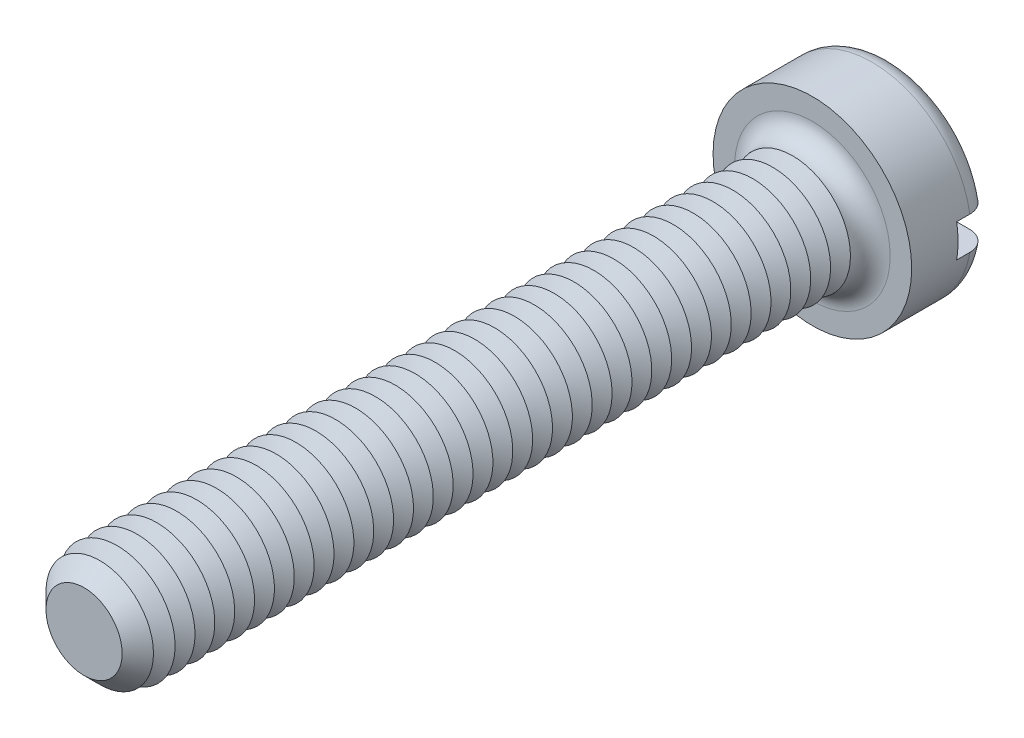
ISO-10303-21;
HEADER;
FILE_DESCRIPTION(('STEP AP214'),'2;1');
FILE_NAME('part.step','',(''),(''),'','','');
FILE_SCHEMA(('AUTOMOTIVE_DESIGN { 1 0 10303 214 1 1 1 1 }'));
ENDSEC;
DATA;
#1=APPLICATION_CONTEXT('core data for automotive mechanical design processes');
#2=APPLICATION_PROTOCOL_DEFINITION('international standard','automotive_design',2000,#1);
#3=PRODUCT_CONTEXT('',#1,'mechanical');
#4=PRODUCT('Part','Part','',(#3));
#5=PRODUCT_RELATED_PRODUCT_CATEGORY('part','',(#4));
#6=PRODUCT_DEFINITION_FORMATION('','',#4);
#7=PRODUCT_DEFINITION_CONTEXT('part definition',#1,'design');
#8=PRODUCT_DEFINITION('design','',#6,#7);
#9=PRODUCT_DEFINITION_SHAPE('','',#8);
#10=(LENGTH_UNIT() NAMED_UNIT(*) SI_UNIT(.MILLI.,.METRE.));
#11=(NAMED_UNIT(*) PLANE_ANGLE_UNIT() SI_UNIT($,.RADIAN.));
#12=(NAMED_UNIT(*) SI_UNIT($,.STERADIAN.) SOLID_ANGLE_UNIT());
#13=UNCERTAINTY_MEASURE_WITH_UNIT(LENGTH_MEASURE(1.E-05),#10,'distance_accuracy_value','');
#14=(GEOMETRIC_REPRESENTATION_CONTEXT(3) GLOBAL_UNCERTAINTY_ASSIGNED_CONTEXT((#13)) GLOBAL_UNIT_ASSIGNED_CONTEXT((#10,
#11,#12)) REPRESENTATION_CONTEXT('',''));
#15=CARTESIAN_POINT('',(0.,0.,0.));
#16=DIRECTION('',(0.,0.,1.));
#17=DIRECTION('',(1.,0.,0.));
#18=AXIS2_PLACEMENT_3D('',#15,#16,#17);
#19=CARTESIAN_POINT('',(0.,0.,-2.4));
#20=DIRECTION('',(0.,0.,1.));
#21=DIRECTION('',(1.,0.,0.));
#22=AXIS2_PLACEMENT_3D('',#19,#20,#21);
#23=PLANE('',#22);
#24=CARTESIAN_POINT('',(0.,0.,-2.4));
#25=DIRECTION('',(0.,0.,1.));
#26=DIRECTION('',(1.,0.,0.));
#27=AXIS2_PLACEMENT_3D('',#24,#25,#26);
#28=CIRCLE('',#27,2.4);
#29=CARTESIAN_POINT('',(-2.3473389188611,0.5,-2.4));
#30=VERTEX_POINT('',#29);
#31=CARTESIAN_POINT('',(2.3473389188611,0.5,-2.4));
#32=VERTEX_POINT('',#31);
#33=EDGE_CURVE('E116',#30,#32,#28,.F.);
#34=ORIENTED_EDGE('',*,*,#33,.T.);
#35=DIRECTION('',(1.,0.,0.));
#36=VECTOR('',#35,1.);
#37=CARTESIAN_POINT('',(-3.,0.5,-2.4));
#38=LINE('',#37,#36);
#39=EDGE_CURVE('E111',#30,#32,#38,.T.);
#40=ORIENTED_EDGE('',*,*,#39,.F.);
#41=EDGE_LOOP('',(#34,#40));
#42=FACE_BOUND('',#41,.T.);
#43=ADVANCED_FACE('F39',(#42),#23,.F.);
#44=CARTESIAN_POINT('',(0.,0.,-1.8));
#45=DIRECTION('',(0.,0.,1.));
#46=DIRECTION('',(1.,0.,0.));
#47=AXIS2_PLACEMENT_3D('',#44,#45,#46);
#48=TOROIDAL_SURFACE('',#47,2.4,0.6);
#49=CARTESIAN_POINT('',(-2.85761641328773,0.5,-2.13010535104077));
#50=CARTESIAN_POINT('',(-2.83871556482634,0.5,-2.1583605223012));
#51=CARTESIAN_POINT('',(-2.81738546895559,0.5,-2.18502342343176));
#52=CARTESIAN_POINT('',(-2.7705148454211,0.5,-2.23439244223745));
#53=CARTESIAN_POINT('',(-2.74496859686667,0.5,-2.25709309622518));
#54=CARTESIAN_POINT('',(-2.6904684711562,0.5,-2.29787524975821));
#55=CARTESIAN_POINT('',(-2.66151863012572,0.5,-2.3159621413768));
#56=CARTESIAN_POINT('',(-2.60103287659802,0.5,-2.34708203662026));
#57=CARTESIAN_POINT('',(-2.56949759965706,0.5,-2.36011627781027));
#58=CARTESIAN_POINT('',(-2.50430694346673,0.5,-2.38095952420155));
#59=CARTESIAN_POINT('',(-2.47062984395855,0.5,-2.38870056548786));
#60=CARTESIAN_POINT('',(-2.40245905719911,0.5,-2.39852415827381));
#61=CARTESIAN_POINT('',(-2.36796525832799,0.5,-2.40060593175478));
#62=CARTESIAN_POINT('',(-2.29850850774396,0.5,-2.39907718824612));
#63=CARTESIAN_POINT('',(-2.2635477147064,0.5,-2.3953679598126));
#64=CARTESIAN_POINT('',(-2.19472542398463,0.5,-2.38219781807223));
#65=CARTESIAN_POINT('',(-2.16086402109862,0.5,-2.37273641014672));
#66=CARTESIAN_POINT('',(-2.09483473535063,0.5,-2.3481926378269));
#67=CARTESIAN_POINT('',(-2.06268841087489,0.5,-2.3330521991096));
#68=CARTESIAN_POINT('',(-2.00140871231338,0.5,-2.29756210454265));
#69=CARTESIAN_POINT('',(-1.97227539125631,0.5,-2.27721235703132));
#70=CARTESIAN_POINT('',(-1.91805676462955,0.5,-2.23196210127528));
#71=CARTESIAN_POINT('',(-1.89294995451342,0.5,-2.20708739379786));
#72=CARTESIAN_POINT('',(-1.84740424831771,0.5,-2.1533758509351));
#73=CARTESIAN_POINT('',(-1.82696468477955,0.5,-2.12453958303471));
#74=CARTESIAN_POINT('',(-1.7919439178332,0.5,-2.06452274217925));
#75=CARTESIAN_POINT('',(-1.7772221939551,0.5,-2.03342424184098));
#76=CARTESIAN_POINT('',(-1.75343025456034,0.5,-1.96913621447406));
#77=CARTESIAN_POINT('',(-1.74435859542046,0.5,-1.93594722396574));
#78=CARTESIAN_POINT('',(-1.73243855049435,0.5,-1.86969199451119));
#79=CARTESIAN_POINT('',(-1.72938008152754,0.5,-1.83666346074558));
#80=CARTESIAN_POINT('',(-1.72896592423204,0.5,-1.77057287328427));
#81=CARTESIAN_POINT('',(-1.73160950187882,0.5,-1.73751082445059));
#82=CARTESIAN_POINT('',(-1.7423966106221,0.5,-1.67291835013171));
#83=CARTESIAN_POINT('',(-1.75043952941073,0.5,-1.64137102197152));
#84=CARTESIAN_POINT('',(-1.77163396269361,0.5,-1.58004446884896));
#85=CARTESIAN_POINT('',(-1.78478577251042,0.5,-1.55026534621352));
#86=CARTESIAN_POINT('',(-1.81598186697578,0.5,-1.49283859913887));
#87=CARTESIAN_POINT('',(-1.83409369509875,0.5,-1.46522772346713));
#88=CARTESIAN_POINT('',(-1.87455179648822,0.5,-1.41330756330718));
#89=CARTESIAN_POINT('',(-1.89689874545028,0.5,-1.38899880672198));
#90=CARTESIAN_POINT('',(-1.94600584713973,0.5,-1.34349499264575));
#91=CARTESIAN_POINT('',(-1.97289034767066,0.5,-1.32243411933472));
#92=CARTESIAN_POINT('',(-2.02972905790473,0.5,-1.28496935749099));
#93=CARTESIAN_POINT('',(-2.05968375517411,0.5,-1.26856621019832));
#94=CARTESIAN_POINT('',(-2.12276894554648,0.5,-1.24040709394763));
#95=CARTESIAN_POINT('',(-2.15596700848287,0.5,-1.22880230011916));
#96=CARTESIAN_POINT('',(-2.22383000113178,0.5,-1.21126311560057));
#97=CARTESIAN_POINT('',(-2.25849504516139,0.5,-1.20532916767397));
#98=CARTESIAN_POINT('',(-2.32870403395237,0.5,-1.1992792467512));
#99=CARTESIAN_POINT('',(-2.36425340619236,0.5,-1.19922586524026));
#100=CARTESIAN_POINT('',(-2.4348506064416,0.5,-1.2051326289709));
#101=CARTESIAN_POINT('',(-2.4698984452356,0.5,-1.21109264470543));
#102=CARTESIAN_POINT('',(-2.53821803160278,0.5,-1.22883658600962));
#103=CARTESIAN_POINT('',(-2.57150081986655,0.5,-1.24057794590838));
#104=CARTESIAN_POINT('',(-2.63557260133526,0.5,-1.2695744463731));
#105=CARTESIAN_POINT('',(-2.66636179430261,0.5,-1.28682914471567));
#106=CARTESIAN_POINT('',(-2.72402406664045,0.5,-1.32606063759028));
#107=CARTESIAN_POINT('',(-2.75095352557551,0.5,-1.34795455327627));
#108=CARTESIAN_POINT('',(-2.80067182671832,0.5,-1.39602603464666));
#109=CARTESIAN_POINT('',(-2.82346106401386,0.5,-1.42220319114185));
#110=CARTESIAN_POINT('',(-2.86383281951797,0.5,-1.47760238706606));
#111=CARTESIAN_POINT('',(-2.88149947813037,0.5,-1.50676312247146));
#112=CARTESIAN_POINT('',(-2.91160874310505,0.5,-1.56766595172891));
#113=CARTESIAN_POINT('',(-2.92405198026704,0.5,-1.59940773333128));
#114=CARTESIAN_POINT('',(-2.94319943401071,0.5,-1.66411282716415));
#115=CARTESIAN_POINT('',(-2.94997843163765,0.5,-1.69705402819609));
#116=CARTESIAN_POINT('',(-2.95787009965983,0.5,-1.7636173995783));
#117=CARTESIAN_POINT('',(-2.95898157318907,0.5,-1.79723971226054));
#118=CARTESIAN_POINT('',(-2.95551354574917,0.5,-1.86397776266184));
#119=CARTESIAN_POINT('',(-2.95096897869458,0.5,-1.89709534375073));
#120=CARTESIAN_POINT('',(-2.93638731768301,0.5,-1.96206785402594));
#121=CARTESIAN_POINT('',(-2.92635713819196,0.5,-1.99392431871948));
#122=CARTESIAN_POINT('',(-2.90618743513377,0.5,-2.04315073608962));
#123=CARTESIAN_POINT('',(-2.89769874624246,0.5,-2.06121519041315));
#124=CARTESIAN_POINT('',(-2.87895753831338,0.5,-2.096404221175));
#125=CARTESIAN_POINT('',(-2.86870503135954,0.5,-2.11352880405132));
#126=CARTESIAN_POINT('',(-2.85761641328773,0.5,-2.13010535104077));
#127=B_SPLINE_CURVE_WITH_KNOTS('',3,(#49,#50,#51,#52,#53,#54,#55,#56,#57,#58,#59,#60,#61,#62,
#63,#64,#65,#66,#67,#68,#69,#70,#71,#72,#73,#74,#75,#76,#77,#78,#79,#80,#81,#82,#83,#84,#85,#86,
#87,#88,#89,#90,#91,#92,#93,#94,#95,#96,#97,#98,#99,#100,#101,#102,#103,#104,#105,#106,#107,
#108,#109,#110,#111,#112,#113,#114,#115,#116,#117,#118,#119,#120,#121,#122,#123,#124,#125,#126),
.UNSPECIFIED.,.T.,.F.,(4,2,2,2,2,2,2,2,2,2,2,2,2,2,2,2,2,2,2,2,2,2,2,2,2,2,2,2,2,2,2,2,2,2,2,2,
2,2,4),(0.,0.101907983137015,0.203955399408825,0.305883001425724,0.407785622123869,
0.510973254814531,0.614175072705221,0.719155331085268,0.824144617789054,0.930238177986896,
1.03633360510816,1.14184204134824,1.24733537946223,1.35004136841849,1.45272110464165,
1.5517448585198,1.65075586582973,1.74797128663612,1.84519232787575,1.9438094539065,
2.0424423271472,2.14443321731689,2.24644032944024,2.35145317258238,2.45647421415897,
2.56261297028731,2.66874944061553,2.77411589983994,2.87947390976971,2.98308820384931,
3.08669260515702,3.18848388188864,3.29026286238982,3.39067588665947,3.49111011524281,
3.59092708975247,3.69061853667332,3.75040561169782,3.81019227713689),.UNSPECIFIED.);
#128=CARTESIAN_POINT('',(-2.95803989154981,0.5,-1.8));
#129=VERTEX_POINT('',#128);
#130=EDGE_CURVE('E464',#129,#30,#127,.T.);
#131=ORIENTED_EDGE('',*,*,#130,.F.);
#132=CARTESIAN_POINT('',(0.,0.,-1.8));
#133=DIRECTION('',(0.,0.,1.));
#134=DIRECTION('',(1.,0.,0.));
#135=AXIS2_PLACEMENT_3D('',#132,#133,#134);
#136=CIRCLE('',#135,3.);
#137=CARTESIAN_POINT('',(2.95803989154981,0.5,-1.8));
#138=VERTEX_POINT('',#137);
#139=EDGE_CURVE('E125',#138,#129,#136,.T.);
#140=ORIENTED_EDGE('',*,*,#139,.F.);
#141=CARTESIAN_POINT('',(1.78664846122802,0.5,-2.05158390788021));
#142=CARTESIAN_POINT('',(1.80142751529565,0.5,-2.08239430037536));
#143=CARTESIAN_POINT('',(1.81889355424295,0.5,-2.111949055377));
#144=CARTESIAN_POINT('',(1.8585933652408,0.5,-2.16770384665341));
#145=CARTESIAN_POINT('',(1.88083491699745,0.5,-2.19389829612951));
#146=CARTESIAN_POINT('',(1.92931942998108,0.5,-2.24217519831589));
#147=CARTESIAN_POINT('',(1.95555471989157,0.5,-2.26426535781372));
#148=CARTESIAN_POINT('',(2.01127789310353,0.5,-2.30384045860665));
#149=CARTESIAN_POINT('',(2.04076488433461,0.5,-2.32132665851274));
#150=CARTESIAN_POINT('',(2.10290022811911,0.5,-2.3516259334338));
#151=CARTESIAN_POINT('',(2.13560600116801,0.5,-2.3643213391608));
#152=CARTESIAN_POINT('',(2.20267136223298,0.5,-2.38412242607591));
#153=CARTESIAN_POINT('',(2.23703118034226,0.5,-2.3912273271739));
#154=CARTESIAN_POINT('',(2.30690186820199,0.5,-2.39969404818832));
#155=CARTESIAN_POINT('',(2.34242185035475,0.5,-2.40098100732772));
#156=CARTESIAN_POINT('',(2.41317063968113,0.5,-2.39753827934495));
#157=CARTESIAN_POINT('',(2.44839945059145,0.5,-2.39280866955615));
#158=CARTESIAN_POINT('',(2.51734146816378,0.5,-2.37746773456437));
#159=CARTESIAN_POINT('',(2.55106223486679,0.5,-2.3668904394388));
#160=CARTESIAN_POINT('',(2.61620389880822,0.5,-2.34013333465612));
#161=CARTESIAN_POINT('',(2.64762498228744,0.5,-2.32395397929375));
#162=CARTESIAN_POINT('',(2.70673284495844,0.5,-2.28672393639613));
#163=CARTESIAN_POINT('',(2.73447138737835,0.5,-2.26575544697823));
#164=CARTESIAN_POINT('',(2.78595339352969,0.5,-2.21938197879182));
#165=CARTESIAN_POINT('',(2.80969724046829,0.5,-2.19397742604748));
#166=CARTESIAN_POINT('',(2.85207235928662,0.5,-2.13993965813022));
#167=CARTESIAN_POINT('',(2.87078674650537,0.5,-2.11137160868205));
#168=CARTESIAN_POINT('',(2.90307455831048,0.5,-2.05146448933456));
#169=CARTESIAN_POINT('',(2.91664841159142,0.5,-2.02012565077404));
#170=CARTESIAN_POINT('',(2.93808283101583,0.5,-1.95603682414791));
#171=CARTESIAN_POINT('',(2.94602016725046,0.5,-1.92331249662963));
#172=CARTESIAN_POINT('',(2.95624273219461,0.5,-1.85699296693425));
#173=CARTESIAN_POINT('',(2.95852824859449,0.5,-1.82339780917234));
#174=CARTESIAN_POINT('',(2.95738171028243,0.5,-1.75655451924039));
#175=CARTESIAN_POINT('',(2.95399174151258,0.5,-1.72330565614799));
#176=CARTESIAN_POINT('',(2.94167749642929,0.5,-1.65784996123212));
#177=CARTESIAN_POINT('',(2.93275329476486,0.5,-1.62564311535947));
#178=CARTESIAN_POINT('',(2.90963870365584,0.5,-1.56317641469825));
#179=CARTESIAN_POINT('',(2.89544787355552,0.5,-1.53291672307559));
#180=CARTESIAN_POINT('',(2.86222325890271,0.5,-1.47518589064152));
#181=CARTESIAN_POINT('',(2.84318935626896,0.5,-1.44771481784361));
#182=CARTESIAN_POINT('',(2.80067851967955,0.5,-1.39611362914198));
#183=CARTESIAN_POINT('',(2.77716960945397,0.5,-1.37200986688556));
#184=CARTESIAN_POINT('',(2.72648704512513,0.5,-1.3280274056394));
#185=CARTESIAN_POINT('',(2.69931317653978,0.5,-1.3081489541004));
#186=CARTESIAN_POINT('',(2.64167967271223,0.5,-1.27288334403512));
#187=CARTESIAN_POINT('',(2.61118015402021,0.5,-1.25756138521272));
#188=CARTESIAN_POINT('',(2.54807315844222,0.5,-1.2321564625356));
#189=CARTESIAN_POINT('',(2.51546550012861,0.5,-1.22207395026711));
#190=CARTESIAN_POINT('',(2.44846246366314,0.5,-1.20724783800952));
#191=CARTESIAN_POINT('',(2.41404584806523,0.5,-1.2026002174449));
#192=CARTESIAN_POINT('',(2.34491756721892,0.5,-1.19904907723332));
#193=CARTESIAN_POINT('',(2.3102058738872,0.5,-1.20014611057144));
#194=CARTESIAN_POINT('',(2.24087507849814,0.5,-1.20808958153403));
#195=CARTESIAN_POINT('',(2.20626660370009,0.5,-1.21502895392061));
#196=CARTESIAN_POINT('',(2.13868705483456,0.5,-1.23457616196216));
#197=CARTESIAN_POINT('',(2.10571611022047,0.5,-1.24718444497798));
#198=CARTESIAN_POINT('',(2.04212010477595,0.5,-1.2778419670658));
#199=CARTESIAN_POINT('',(2.0115131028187,0.5,-1.29592871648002));
#200=CARTESIAN_POINT('',(1.95381117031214,0.5,-1.33703838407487));
#201=CARTESIAN_POINT('',(1.92671618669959,0.5,-1.36006122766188));
#202=CARTESIAN_POINT('',(1.8771749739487,0.5,-1.41014760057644));
#203=CARTESIAN_POINT('',(1.85467966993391,0.5,-1.43716252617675));
#204=CARTESIAN_POINT('',(1.8147167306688,0.5,-1.49468601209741));
#205=CARTESIAN_POINT('',(1.79724791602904,0.5,-1.52519375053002));
#206=CARTESIAN_POINT('',(1.76843420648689,0.5,-1.58782676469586));
#207=CARTESIAN_POINT('',(1.75691546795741,0.5,-1.61987202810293));
#208=CARTESIAN_POINT('',(1.73963101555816,0.5,-1.68548715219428));
#209=CARTESIAN_POINT('',(1.73386545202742,0.5,-1.71905705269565));
#210=CARTESIAN_POINT('',(1.72840927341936,0.5,-1.78556262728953));
#211=CARTESIAN_POINT('',(1.72852416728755,0.5,-1.8184825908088));
#212=CARTESIAN_POINT('',(1.73434422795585,0.5,-1.88379362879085));
#213=CARTESIAN_POINT('',(1.74004181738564,0.5,-1.91618535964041));
#214=CARTESIAN_POINT('',(1.75312909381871,0.5,-1.96568884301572));
#215=CARTESIAN_POINT('',(1.75869685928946,0.5,-1.98330302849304));
#216=CARTESIAN_POINT('',(1.77146455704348,0.5,-2.01792824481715));
#217=CARTESIAN_POINT('',(1.7786644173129,0.5,-2.03493930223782));
#218=CARTESIAN_POINT('',(1.78664846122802,0.5,-2.05158390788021));
#219=B_SPLINE_CURVE_WITH_KNOTS('',3,(#141,#142,#143,#144,#145,#146,#147,#148,#149,#150,#151,
#152,#153,#154,#155,#156,#157,#158,#159,#160,#161,#162,#163,#164,#165,#166,#167,#168,#169,#170,
#171,#172,#173,#174,#175,#176,#177,#178,#179,#180,#181,#182,#183,#184,#185,#186,#187,#188,#189,
#190,#191,#192,#193,#194,#195,#196,#197,#198,#199,#200,#201,#202,#203,#204,#205,#206,#207,#208,
#209,#210,#211,#212,#213,#214,#215,#216,#217,#218),.UNSPECIFIED.,.T.,.F.,(4,2,2,2,2,2,2,2,2,2,2,
2,2,2,2,2,2,2,2,2,2,2,2,2,2,2,2,2,2,2,2,2,2,2,2,2,2,2,4),(0.,0.10244464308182,0.205057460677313,
0.307475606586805,0.409865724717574,0.514628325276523,0.619405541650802,0.72552718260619,
0.831647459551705,0.937156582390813,1.04265715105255,1.1464674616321,1.25026780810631,
1.3522293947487,1.45418247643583,1.55471883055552,1.6552500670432,1.75503912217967,
1.8548268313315,1.95462289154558,2.05442138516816,2.15496174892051,2.25550799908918,
2.35743049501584,2.45936177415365,2.56306719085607,2.66678259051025,2.77217967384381,
2.87758507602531,2.98372914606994,3.08987161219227,3.19481457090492,3.29973288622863,
3.40138228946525,3.50303434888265,3.60132659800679,3.69948562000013,3.75483142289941,
3.8101747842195),.UNSPECIFIED.);
#220=EDGE_CURVE('E466',#32,#138,#219,.T.);
#221=ORIENTED_EDGE('',*,*,#220,.F.);
#222=ORIENTED_EDGE('',*,*,#33,.F.);
#223=EDGE_LOOP('',(#131,#140,#221,#222));
#224=FACE_BOUND('',#223,.T.);
#225=ADVANCED_FACE('F448',(#224),#48,.T.);
#226=CARTESIAN_POINT('',(0.,0.,-2.4));
#227=DIRECTION('',(0.,0.,1.));
#228=DIRECTION('',(1.,0.,0.));
#229=AXIS2_PLACEMENT_3D('',#226,#227,#228);
#230=CYLINDRICAL_SURFACE('',#229,3.);
#231=DIRECTION('',(0.,0.,1.));
#232=VECTOR('',#231,1.);
#233=CARTESIAN_POINT('',(2.95803989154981,0.5,-2.4));
#234=LINE('',#233,#232);
#235=CARTESIAN_POINT('',(2.95803989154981,0.5,-1.4));
#236=VERTEX_POINT('',#235);
#237=EDGE_CURVE('E480',#138,#236,#234,.T.);
#238=ORIENTED_EDGE('',*,*,#237,.F.);
#239=ORIENTED_EDGE('',*,*,#139,.T.);
#240=DIRECTION('',(0.,0.,1.));
#241=VECTOR('',#240,1.);
#242=CARTESIAN_POINT('',(-2.95803989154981,0.5,-2.4));
#243=LINE('',#242,#241);
#244=CARTESIAN_POINT('',(-2.95803989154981,0.5,-1.4));
#245=VERTEX_POINT('',#244);
#246=EDGE_CURVE('E63',#245,#129,#243,.F.);
#247=ORIENTED_EDGE('',*,*,#246,.F.);
#248=CARTESIAN_POINT('',(0.,0.,-1.4));
#249=DIRECTION('',(0.,0.,-1.));
#250=DIRECTION('',(-1.,0.,0.));
#251=AXIS2_PLACEMENT_3D('',#248,#249,#250);
#252=CIRCLE('',#251,3.);
#253=CARTESIAN_POINT('',(-2.95803989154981,-0.5,-1.4));
#254=VERTEX_POINT('',#253);
#255=EDGE_CURVE('E43',#245,#254,#252,.F.);
#256=ORIENTED_EDGE('',*,*,#255,.T.);
#257=DIRECTION('',(0.,0.,1.));
#258=VECTOR('',#257,1.);
#259=CARTESIAN_POINT('',(-2.95803989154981,-0.5,-2.4));
#260=LINE('',#259,#258);
#261=CARTESIAN_POINT('',(-2.9580398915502,-0.5,-1.79999999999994));
#262=VERTEX_POINT('',#261);
#263=EDGE_CURVE('E478',#262,#254,#260,.T.);
#264=ORIENTED_EDGE('',*,*,#263,.F.);
#265=CARTESIAN_POINT('',(2.95803989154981,-0.5,-1.8));
#266=VERTEX_POINT('',#265);
#267=EDGE_CURVE('E127',#262,#266,#136,.T.);
#268=ORIENTED_EDGE('',*,*,#267,.T.);
#269=DIRECTION('',(0.,0.,1.));
#270=VECTOR('',#269,1.);
#271=CARTESIAN_POINT('',(2.95803989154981,-0.5,-2.4));
#272=LINE('',#271,#270);
#273=CARTESIAN_POINT('',(2.95803989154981,-0.5,-1.4));
#274=VERTEX_POINT('',#273);
#275=EDGE_CURVE('E55',#274,#266,#272,.F.);
#276=ORIENTED_EDGE('',*,*,#275,.F.);
#277=EDGE_CURVE('E11',#274,#236,#252,.F.);
#278=ORIENTED_EDGE('',*,*,#277,.T.);
#279=EDGE_LOOP('',(#238,#239,#247,#256,#264,#268,#276,#278));
#280=FACE_BOUND('',#279,.T.);
#281=CARTESIAN_POINT('',(0.,0.,0.));
#282=DIRECTION('',(0.,0.,1.));
#283=DIRECTION('',(1.,0.,0.));
#284=AXIS2_PLACEMENT_3D('',#281,#282,#283);
#285=CIRCLE('',#284,3.);
#286=CARTESIAN_POINT('',(3.,0.,0.));
#287=VERTEX_POINT('',#286);
#288=EDGE_CURVE('E482',#287,#287,#285,.T.);
#289=ORIENTED_EDGE('',*,*,#288,.F.);
#290=EDGE_LOOP('',(#289));
#291=FACE_BOUND('',#290,.T.);
#292=ADVANCED_FACE('F444',(#280,#291),#230,.T.);
#293=CARTESIAN_POINT('',(2.3473389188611,-0.5,-2.4));
#294=VERTEX_POINT('',#293);
#295=CARTESIAN_POINT('',(-2.3473389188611,-0.5,-2.4));
#296=VERTEX_POINT('',#295);
#297=EDGE_CURVE('E109',#294,#296,#28,.F.);
#298=ORIENTED_EDGE('',*,*,#297,.T.);
#299=DIRECTION('',(-1.,0.,0.));
#300=VECTOR('',#299,1.);
#301=CARTESIAN_POINT('',(-3.,-0.5,-2.4));
#302=LINE('',#301,#300);
#303=EDGE_CURVE('E96',#294,#296,#302,.T.);
#304=ORIENTED_EDGE('',*,*,#303,.F.);
#305=EDGE_LOOP('',(#298,#304));
#306=FACE_BOUND('',#305,.T.);
#307=ADVANCED_FACE('F108',(#306),#23,.F.);
#308=CARTESIAN_POINT('',(0.,0.,0.));
#309=DIRECTION('',(0.,0.,1.));
#310=DIRECTION('',(1.,0.,0.));
#311=AXIS2_PLACEMENT_3D('',#308,#309,#310);
#312=PLANE('',#311);
#313=CARTESIAN_POINT('',(0.,0.,0.));
#314=DIRECTION('',(0.,0.,1.));
#315=DIRECTION('',(1.,0.,0.));
#316=AXIS2_PLACEMENT_3D('',#313,#314,#315);
#317=CIRCLE('',#316,2.35);
#318=CARTESIAN_POINT('',(2.35,0.,0.));
#319=VERTEX_POINT('',#318);
#320=EDGE_CURVE('E115',#319,#319,#317,.F.);
#321=ORIENTED_EDGE('',*,*,#320,.T.);
#322=EDGE_LOOP('',(#321));
#323=FACE_BOUND('',#322,.T.);
#324=ORIENTED_EDGE('',*,*,#288,.T.);
#325=EDGE_LOOP('',(#324));
#326=FACE_BOUND('',#325,.T.);
#327=ADVANCED_FACE('F443',(#323,#326),#312,.T.);
#328=CARTESIAN_POINT('',(-2.85761641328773,-0.5,-2.13010535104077));
#329=CARTESIAN_POINT('',(-2.87617085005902,-0.5,-2.10236255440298));
#330=CARTESIAN_POINT('',(-2.89241094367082,-0.5,-2.07304478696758));
#331=CARTESIAN_POINT('',(-2.91975805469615,-0.5,-2.01207835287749));
#332=CARTESIAN_POINT('',(-2.93085958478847,-0.5,-1.98042723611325));
#333=CARTESIAN_POINT('',(-2.94757590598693,-0.5,-1.91570997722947));
#334=CARTESIAN_POINT('',(-2.95319165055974,-0.5,-1.88264408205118));
#335=CARTESIAN_POINT('',(-2.95876526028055,-0.5,-1.81604673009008));
#336=CARTESIAN_POINT('',(-2.95872441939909,-0.5,-1.78251538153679));
#337=CARTESIAN_POINT('',(-2.95300126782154,-0.5,-1.71606888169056));
#338=CARTESIAN_POINT('',(-2.94734076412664,-0.5,-1.68315184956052));
#339=CARTESIAN_POINT('',(-2.93058183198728,-0.5,-1.61873244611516));
#340=CARTESIAN_POINT('',(-2.91948325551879,-0.5,-1.58723011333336));
#341=CARTESIAN_POINT('',(-2.89215903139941,-0.5,-1.52647404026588));
#342=CARTESIAN_POINT('',(-2.87592518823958,-0.5,-1.49722398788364));
#343=CARTESIAN_POINT('',(-2.83881787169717,-0.5,-1.44183365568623));
#344=CARTESIAN_POINT('',(-2.81794425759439,-0.5,-1.41569347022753));
#345=CARTESIAN_POINT('',(-2.77196258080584,-0.5,-1.36700890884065));
#346=CARTESIAN_POINT('',(-2.74681874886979,-0.5,-1.34449832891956));
#347=CARTESIAN_POINT('',(-2.69315595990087,-0.5,-1.30394571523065));
#348=CARTESIAN_POINT('',(-2.66463678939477,-0.5,-1.28590396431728));
#349=CARTESIAN_POINT('',(-2.6045885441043,-0.5,-1.25451133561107));
#350=CARTESIAN_POINT('',(-2.573021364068,-0.5,-1.24123336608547));
#351=CARTESIAN_POINT('',(-2.50813094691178,-0.5,-1.22006271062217));
#352=CARTESIAN_POINT('',(-2.47480755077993,-0.5,-1.21217051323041));
#353=CARTESIAN_POINT('',(-2.40672281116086,-0.5,-1.20185046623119));
#354=CARTESIAN_POINT('',(-2.37194646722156,-0.5,-1.19952155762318));
#355=CARTESIAN_POINT('',(-2.30248663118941,-0.5,-1.20064178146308));
#356=CARTESIAN_POINT('',(-2.26780314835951,-0.5,-1.20409147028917));
#357=CARTESIAN_POINT('',(-2.19896003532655,-0.5,-1.21674803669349));
#358=CARTESIAN_POINT('',(-2.16481620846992,-0.5,-1.22604100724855));
#359=CARTESIAN_POINT('',(-2.09855902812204,-0.5,-1.25020237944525));
#360=CARTESIAN_POINT('',(-2.0664458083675,-0.5,-1.2650711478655));
#361=CARTESIAN_POINT('',(-2.00504979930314,-0.5,-1.3000633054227));
#362=CARTESIAN_POINT('',(-1.97577870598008,-0.5,-1.32020724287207));
#363=CARTESIAN_POINT('',(-1.92109882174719,-0.5,-1.36519538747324));
#364=CARTESIAN_POINT('',(-1.89568984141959,-0.5,-1.39003936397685));
#365=CARTESIAN_POINT('',(-1.84992350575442,-0.5,-1.44333696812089));
#366=CARTESIAN_POINT('',(-1.82949305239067,-0.5,-1.47172774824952));
#367=CARTESIAN_POINT('',(-1.79388305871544,-0.5,-1.53163225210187));
#368=CARTESIAN_POINT('',(-1.77870235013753,-0.5,-1.56314527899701));
#369=CARTESIAN_POINT('',(-1.7545759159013,-0.5,-1.62726698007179));
#370=CARTESIAN_POINT('',(-1.74543784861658,-0.5,-1.65980327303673));
#371=CARTESIAN_POINT('',(-1.73294830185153,-0.5,-1.72596654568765));
#372=CARTESIAN_POINT('',(-1.72959555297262,-0.5,-1.7595932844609));
#373=CARTESIAN_POINT('',(-1.72881879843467,-0.5,-1.82588200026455));
#374=CARTESIAN_POINT('',(-1.73121660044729,-0.5,-1.85854202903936));
#375=CARTESIAN_POINT('',(-1.74148022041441,-0.5,-1.9229888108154));
#376=CARTESIAN_POINT('',(-1.74934586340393,-0.5,-1.95477559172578));
#377=CARTESIAN_POINT('',(-1.77023164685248,-0.5,-2.01650910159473));
#378=CARTESIAN_POINT('',(-1.78323812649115,-0.5,-2.04646046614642));
#379=CARTESIAN_POINT('',(-1.81396733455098,-0.5,-2.10383471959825));
#380=CARTESIAN_POINT('',(-1.83169061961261,-0.5,-2.13125730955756));
#381=CARTESIAN_POINT('',(-1.87183626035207,-0.5,-2.18359240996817));
#382=CARTESIAN_POINT('',(-1.89437158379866,-0.5,-2.20841820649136));
#383=CARTESIAN_POINT('',(-1.9431646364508,-0.5,-2.25409214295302));
#384=CARTESIAN_POINT('',(-1.96942301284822,-0.5,-2.27493958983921));
#385=CARTESIAN_POINT('',(-2.025898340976,-0.5,-2.31281042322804));
#386=CARTESIAN_POINT('',(-2.05622082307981,-0.5,-2.32967654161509));
#387=CARTESIAN_POINT('',(-2.11922391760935,-0.5,-2.35820255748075));
#388=CARTESIAN_POINT('',(-2.15190483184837,-0.5,-2.3698617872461));
#389=CARTESIAN_POINT('',(-2.21944675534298,-0.5,-2.38785911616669));
#390=CARTESIAN_POINT('',(-2.25433929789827,-0.5,-2.39407914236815));
#391=CARTESIAN_POINT('',(-2.32467357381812,-0.5,-2.40058243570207));
#392=CARTESIAN_POINT('',(-2.36011530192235,-0.5,-2.40086575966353));
#393=CARTESIAN_POINT('',(-2.43058129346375,-0.5,-2.39545061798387));
#394=CARTESIAN_POINT('',(-2.46560504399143,-0.5,-2.38974544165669));
#395=CARTESIAN_POINT('',(-2.53418188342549,-0.5,-2.37245602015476));
#396=CARTESIAN_POINT('',(-2.56773468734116,-0.5,-2.36087064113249));
#397=CARTESIAN_POINT('',(-2.63195003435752,-0.5,-2.33229154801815));
#398=CARTESIAN_POINT('',(-2.66264330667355,-0.5,-2.31536681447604));
#399=CARTESIAN_POINT('',(-2.72065333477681,-0.5,-2.2765252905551));
#400=CARTESIAN_POINT('',(-2.7479744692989,-0.5,-2.25461508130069));
#401=CARTESIAN_POINT('',(-2.78903570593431,-0.5,-2.21539504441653));
#402=CARTESIAN_POINT('',(-2.80405150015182,-0.5,-2.19939833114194));
#403=CARTESIAN_POINT('',(-2.83224965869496,-0.5,-2.16586257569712));
#404=CARTESIAN_POINT('',(-2.84543204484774,-0.5,-2.14832355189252));
#405=CARTESIAN_POINT('',(-2.85761641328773,-0.5,-2.13010535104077));
#406=B_SPLINE_CURVE_WITH_KNOTS('',3,(#328,#329,#330,#331,#332,#333,#334,#335,#336,#337,#338,
#339,#340,#341,#342,#343,#344,#345,#346,#347,#348,#349,#350,#351,#352,#353,#354,#355,#356,#357,
#358,#359,#360,#361,#362,#363,#364,#365,#366,#367,#368,#369,#370,#371,#372,#373,#374,#375,#376,
#377,#378,#379,#380,#381,#382,#383,#384,#385,#386,#387,#388,#389,#390,#391,#392,#393,#394,#395,
#396,#397,#398,#399,#400,#401,#402,#403,#404,#405),.UNSPECIFIED.,.T.,.F.,(4,2,2,2,2,2,2,2,2,2,2,
2,2,2,2,2,2,2,2,2,2,2,2,2,2,2,2,2,2,2,2,2,2,2,2,2,2,2,4),(0.,0.100047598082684,
0.200201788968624,0.300338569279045,0.400452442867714,0.500179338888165,0.599908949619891,
0.699798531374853,0.799691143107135,0.900465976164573,1.00124718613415,1.10351091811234,
1.20578392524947,1.30986270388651,1.41395150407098,1.51961105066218,1.62527754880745,
1.73136193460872,1.83744111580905,1.94185359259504,2.04624281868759,2.1471248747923,
2.24798479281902,2.34575994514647,2.44353196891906,2.541045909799,2.63857136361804,
2.73870431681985,2.83885469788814,2.94247024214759,3.0460990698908,3.15192527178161,
3.25775046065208,3.36369436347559,3.46965870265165,3.57430655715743,3.67881706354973,
3.74451732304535,3.81021680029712),.UNSPECIFIED.);
#407=EDGE_CURVE('E103',#296,#262,#406,.T.);
#408=ORIENTED_EDGE('',*,*,#407,.F.);
#409=ORIENTED_EDGE('',*,*,#297,.F.);
#410=CARTESIAN_POINT('',(1.78664846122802,-0.5,-2.05158390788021));
#411=CARTESIAN_POINT('',(1.77253256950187,-0.5,-2.02214917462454));
#412=CARTESIAN_POINT('',(1.76084795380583,-0.5,-1.99152692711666));
#413=CARTESIAN_POINT('',(1.74276267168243,-0.5,-1.92873811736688));
#414=CARTESIAN_POINT('',(1.73636622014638,-0.5,-1.89657034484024));
#415=CARTESIAN_POINT('',(1.72910271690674,-0.5,-1.83160458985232));
#416=CARTESIAN_POINT('',(1.72823699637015,-0.5,-1.79880645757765));
#417=CARTESIAN_POINT('',(1.73207277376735,-0.5,-1.73354460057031));
#418=CARTESIAN_POINT('',(1.7367732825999,-0.5,-1.70108081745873));
#419=CARTESIAN_POINT('',(1.75151033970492,-0.5,-1.63763571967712));
#420=CARTESIAN_POINT('',(1.76150868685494,-0.5,-1.60664550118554));
#421=CARTESIAN_POINT('',(1.78646773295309,-0.5,-1.54673433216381));
#422=CARTESIAN_POINT('',(1.80142897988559,-0.5,-1.51781361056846));
#423=CARTESIAN_POINT('',(1.8361687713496,-0.5,-1.46223275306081));
#424=CARTESIAN_POINT('',(1.85603637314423,-0.5,-1.43562834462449));
#425=CARTESIAN_POINT('',(1.89981598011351,-0.5,-1.38598822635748));
#426=CARTESIAN_POINT('',(1.92372865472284,-0.5,-1.3629531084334));
#427=CARTESIAN_POINT('',(1.97581791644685,-0.5,-1.32025912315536));
#428=CARTESIAN_POINT('',(2.00411431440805,-0.5,-1.30074638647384));
#429=CARTESIAN_POINT('',(2.06351340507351,-0.5,-1.26660223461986));
#430=CARTESIAN_POINT('',(2.09461651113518,-0.5,-1.2519715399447));
#431=CARTESIAN_POINT('',(2.15964055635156,-0.5,-1.22763649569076));
#432=CARTESIAN_POINT('',(2.19361437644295,-0.5,-1.21807321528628));
#433=CARTESIAN_POINT('',(2.26268197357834,-0.5,-1.20474094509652));
#434=CARTESIAN_POINT('',(2.29777581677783,-0.5,-1.20097229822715));
#435=CARTESIAN_POINT('',(2.36834397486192,-0.5,-1.19935270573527));
#436=CARTESIAN_POINT('',(2.40381924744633,-0.5,-1.20154258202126));
#437=CARTESIAN_POINT('',(2.47388621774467,-0.5,-1.211906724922));
#438=CARTESIAN_POINT('',(2.50847794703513,-0.5,-1.22008077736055));
#439=CARTESIAN_POINT('',(2.57542869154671,-0.5,-1.24211740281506));
#440=CARTESIAN_POINT('',(2.60780612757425,-0.5,-1.25592395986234));
#441=CARTESIAN_POINT('',(2.66972487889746,-0.5,-1.28886991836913));
#442=CARTESIAN_POINT('',(2.69926644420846,-0.5,-1.3080088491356));
#443=CARTESIAN_POINT('',(2.75412764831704,-0.5,-1.35072337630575));
#444=CARTESIAN_POINT('',(2.77951140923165,-0.5,-1.37421661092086));
#445=CARTESIAN_POINT('',(2.82588981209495,-0.5,-1.42519687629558));
#446=CARTESIAN_POINT('',(2.84688487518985,-0.5,-1.4526835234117));
#447=CARTESIAN_POINT('',(2.88351678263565,-0.5,-1.51036368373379));
#448=CARTESIAN_POINT('',(2.89923879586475,-0.5,-1.54050312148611));
#449=CARTESIAN_POINT('',(2.92532780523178,-0.5,-1.60301687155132));
#450=CARTESIAN_POINT('',(2.93569520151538,-0.5,-1.63539101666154));
#451=CARTESIAN_POINT('',(2.95066155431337,-0.5,-1.70102985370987));
#452=CARTESIAN_POINT('',(2.95532930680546,-0.5,-1.73427887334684));
#453=CARTESIAN_POINT('',(2.9589838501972,-0.5,-1.80108716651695));
#454=CARTESIAN_POINT('',(2.95797087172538,-0.5,-1.83464642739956));
#455=CARTESIAN_POINT('',(2.9503157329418,-0.5,-1.90093629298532));
#456=CARTESIAN_POINT('',(2.9437032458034,-0.5,-1.93367033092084));
#457=CARTESIAN_POINT('',(2.92508830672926,-0.5,-1.99756717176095));
#458=CARTESIAN_POINT('',(2.91308586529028,-0.5,-2.02872997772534));
#459=CARTESIAN_POINT('',(2.88401713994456,-0.5,-2.08868263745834));
#460=CARTESIAN_POINT('',(2.86693946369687,-0.5,-2.11746696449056));
#461=CARTESIAN_POINT('',(2.82823635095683,-0.5,-2.17179415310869));
#462=CARTESIAN_POINT('',(2.80661076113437,-0.5,-2.19733690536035));
#463=CARTESIAN_POINT('',(2.75921750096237,-0.5,-2.24472182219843));
#464=CARTESIAN_POINT('',(2.73341278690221,-0.5,-2.26652692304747));
#465=CARTESIAN_POINT('',(2.67855512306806,-0.5,-2.30557116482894));
#466=CARTESIAN_POINT('',(2.64950194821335,-0.5,-2.32280998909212));
#467=CARTESIAN_POINT('',(2.58850670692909,-0.5,-2.35251615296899));
#468=CARTESIAN_POINT('',(2.55652763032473,-0.5,-2.36490748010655));
#469=CARTESIAN_POINT('',(2.4909651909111,-0.5,-2.38424946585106));
#470=CARTESIAN_POINT('',(2.45738167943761,-0.5,-2.39119961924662));
#471=CARTESIAN_POINT('',(2.38892891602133,-0.5,-2.39958830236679));
#472=CARTESIAN_POINT('',(2.35404742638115,-0.5,-2.40092701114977));
#473=CARTESIAN_POINT('',(2.28454389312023,-0.5,-2.39781917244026));
#474=CARTESIAN_POINT('',(2.24992186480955,-0.5,-2.39337228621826));
#475=CARTESIAN_POINT('',(2.18139250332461,-0.5,-2.37872879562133));
#476=CARTESIAN_POINT('',(2.14750264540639,-0.5,-2.36845030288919));
#477=CARTESIAN_POINT('',(2.08190943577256,-0.5,-2.34236291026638));
#478=CARTESIAN_POINT('',(2.05020675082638,-0.5,-2.32655233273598));
#479=CARTESIAN_POINT('',(1.98982495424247,-0.5,-2.28976285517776));
#480=CARTESIAN_POINT('',(1.96115527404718,-0.5,-2.26876847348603));
#481=CARTESIAN_POINT('',(1.90785147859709,-0.5,-2.22220002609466));
#482=CARTESIAN_POINT('',(1.88321231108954,-0.5,-2.19663177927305));
#483=CARTESIAN_POINT('',(1.84638483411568,-0.5,-2.15106161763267));
#484=CARTESIAN_POINT('',(1.8328227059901,-0.5,-2.13215328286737));
#485=CARTESIAN_POINT('',(1.80797918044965,-0.5,-2.09289185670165));
#486=CARTESIAN_POINT('',(1.79669771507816,-0.5,-2.07253880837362));
#487=CARTESIAN_POINT('',(1.78664846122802,-0.5,-2.05158390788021));
#488=B_SPLINE_CURVE_WITH_KNOTS('',3,(#410,#411,#412,#413,#414,#415,#416,#417,#418,#419,#420,
#421,#422,#423,#424,#425,#426,#427,#428,#429,#430,#431,#432,#433,#434,#435,#436,#437,#438,#439,
#440,#441,#442,#443,#444,#445,#446,#447,#448,#449,#450,#451,#452,#453,#454,#455,#456,#457,#458,
#459,#460,#461,#462,#463,#464,#465,#466,#467,#468,#469,#470,#471,#472,#473,#474,#475,#476,#477,
#478,#479,#480,#481,#482,#483,#484,#485,#486,#487),.UNSPECIFIED.,.T.,.F.,(4,2,2,2,2,2,2,2,2,2,2,
2,2,2,2,2,2,2,2,2,2,2,2,2,2,2,2,2,2,2,2,2,2,2,2,2,2,2,4),(0.,0.0978512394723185,0.19578039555,
0.293733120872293,0.391668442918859,0.488907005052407,0.58615630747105,0.685320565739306,
0.784501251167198,0.887148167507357,0.989810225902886,1.09519726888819,1.20059054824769,
1.30670769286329,1.41282103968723,1.51790384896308,1.62297738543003,1.72623563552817,
1.82948397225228,1.93097382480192,2.03245609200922,2.13270093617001,2.23294171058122,
2.33265458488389,2.43236726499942,2.53230548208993,2.63224706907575,2.73312861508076,
2.83401715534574,2.93642973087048,3.03885181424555,3.14308833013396,3.24733094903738,
3.35307493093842,3.45885100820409,3.56494689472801,3.67090875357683,3.74057217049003,
3.81023351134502),.UNSPECIFIED.);
#489=EDGE_CURVE('E92',#266,#294,#488,.T.);
#490=ORIENTED_EDGE('',*,*,#489,.F.);
#491=ORIENTED_EDGE('',*,*,#267,.F.);
#492=EDGE_LOOP('',(#408,#409,#490,#491));
#493=FACE_BOUND('',#492,.T.);
#494=ADVANCED_FACE('F113',(#493),#48,.T.);
#495=CARTESIAN_POINT('',(0.,0.,0.6));
#496=DIRECTION('',(0.,0.,1.));
#497=DIRECTION('',(1.,0.,0.));
#498=AXIS2_PLACEMENT_3D('',#495,#496,#497);
#499=TOROIDAL_SURFACE('',#498,2.35,0.6);
#500=ORIENTED_EDGE('',*,*,#320,.F.);
#501=EDGE_LOOP('',(#500));
#502=FACE_BOUND('',#501,.T.);
#503=CARTESIAN_POINT('',(0.,0.,0.6));
#504=DIRECTION('',(0.,0.,-1.));
#505=DIRECTION('',(-1.,0.,0.));
#506=AXIS2_PLACEMENT_3D('',#503,#504,#505);
#507=CIRCLE('',#506,1.75);
#508=CARTESIAN_POINT('',(-1.75,0.,0.6));
#509=VERTEX_POINT('',#508);
#510=EDGE_CURVE('E487',#509,#509,#507,.T.);
#511=ORIENTED_EDGE('',*,*,#510,.T.);
#512=EDGE_LOOP('',(#511));
#513=FACE_BOUND('',#512,.T.);
#514=ADVANCED_FACE('F436',(#502,#513),#499,.F.);
#515=CARTESIAN_POINT('',(0.,0.,0.9));
#516=DIRECTION('',(0.,0.,-1.));
#517=DIRECTION('',(-1.,0.,0.));
#518=AXIS2_PLACEMENT_3D('',#515,#516,#517);
#519=CONICAL_SURFACE('',#518,1.23038475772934,1.0471975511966);
#520=ORIENTED_EDGE('',*,*,#510,.F.);
#521=EDGE_LOOP('',(#520));
#522=FACE_BOUND('',#521,.T.);
#523=CARTESIAN_POINT('',(0.,0.,0.9));
#524=DIRECTION('',(0.,0.,-1.));
#525=DIRECTION('',(-1.,0.,0.));
#526=AXIS2_PLACEMENT_3D('',#523,#524,#525);
#527=CIRCLE('',#526,1.23038475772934);
#528=CARTESIAN_POINT('',(-1.23038475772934,0.,0.9));
#529=VERTEX_POINT('',#528);
#530=EDGE_CURVE('E493',#529,#529,#527,.T.);
#531=ORIENTED_EDGE('',*,*,#530,.T.);
#532=EDGE_LOOP('',(#531));
#533=FACE_BOUND('',#532,.T.);
#534=ADVANCED_FACE('F432',(#522,#533),#519,.T.);
#535=CARTESIAN_POINT('',(0.,0.,1.2));
#536=DIRECTION('',(0.,0.,1.));
#537=DIRECTION('',(1.,0.,0.));
#538=AXIS2_PLACEMENT_3D('',#535,#536,#537);
#539=CONICAL_SURFACE('',#538,1.75,1.0471975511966);
#540=ORIENTED_EDGE('',*,*,#530,.F.);
#541=EDGE_LOOP('',(#540));
#542=FACE_BOUND('',#541,.T.);
#543=CARTESIAN_POINT('',(0.,0.,1.2));
#544=DIRECTION('',(0.,0.,-1.));
#545=DIRECTION('',(-1.,0.,0.));
#546=AXIS2_PLACEMENT_3D('',#543,#544,#545);
#547=CIRCLE('',#546,1.75);
#548=CARTESIAN_POINT('',(-1.75,0.,1.2));
#549=VERTEX_POINT('',#548);
#550=EDGE_CURVE('E499',#549,#549,#547,.T.);
#551=ORIENTED_EDGE('',*,*,#550,.T.);
#552=EDGE_LOOP('',(#551));
#553=FACE_BOUND('',#552,.T.);
#554=ADVANCED_FACE('F428',(#542,#553),#539,.T.);
#555=CARTESIAN_POINT('',(0.,0.,1.5));
#556=DIRECTION('',(0.,0.,-1.));
#557=DIRECTION('',(-1.,0.,0.));
#558=AXIS2_PLACEMENT_3D('',#555,#556,#557);
#559=CONICAL_SURFACE('',#558,1.23038475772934,1.0471975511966);
#560=ORIENTED_EDGE('',*,*,#550,.F.);
#561=EDGE_LOOP('',(#560));
#562=FACE_BOUND('',#561,.T.);
#563=CARTESIAN_POINT('',(0.,0.,1.5));
#564=DIRECTION('',(0.,0.,-1.));
#565=DIRECTION('',(-1.,0.,0.));
#566=AXIS2_PLACEMENT_3D('',#563,#564,#565);
#567=CIRCLE('',#566,1.23038475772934);
#568=CARTESIAN_POINT('',(-1.23038475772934,0.,1.5));
#569=VERTEX_POINT('',#568);
#570=EDGE_CURVE('E503',#569,#569,#567,.T.);
#571=ORIENTED_EDGE('',*,*,#570,.T.);
#572=EDGE_LOOP('',(#571));
#573=FACE_BOUND('',#572,.T.);
#574=ADVANCED_FACE('F424',(#562,#573),#559,.T.);
#575=CARTESIAN_POINT('',(0.,0.,1.8));
#576=DIRECTION('',(0.,0.,1.));
#577=DIRECTION('',(1.,0.,0.));
#578=AXIS2_PLACEMENT_3D('',#575,#576,#577);
#579=CONICAL_SURFACE('',#578,1.75,1.0471975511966);
#580=ORIENTED_EDGE('',*,*,#570,.F.);
#581=EDGE_LOOP('',(#580));
#582=FACE_BOUND('',#581,.T.);
#583=CARTESIAN_POINT('',(0.,0.,1.8));
#584=DIRECTION('',(0.,0.,-1.));
#585=DIRECTION('',(-1.,0.,0.));
#586=AXIS2_PLACEMENT_3D('',#583,#584,#585);
#587=CIRCLE('',#586,1.75);
#588=CARTESIAN_POINT('',(-1.75,0.,1.8));
#589=VERTEX_POINT('',#588);
#590=EDGE_CURVE('E507',#589,#589,#587,.T.);
#591=ORIENTED_EDGE('',*,*,#590,.T.);
#592=EDGE_LOOP('',(#591));
#593=FACE_BOUND('',#592,.T.);
#594=ADVANCED_FACE('F420',(#582,#593),#579,.T.);
#595=CARTESIAN_POINT('',(0.,0.,2.1));
#596=DIRECTION('',(0.,0.,-1.));
#597=DIRECTION('',(-1.,0.,0.));
#598=AXIS2_PLACEMENT_3D('',#595,#596,#597);
#599=CONICAL_SURFACE('',#598,1.23038475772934,1.0471975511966);
#600=ORIENTED_EDGE('',*,*,#590,.F.);
#601=EDGE_LOOP('',(#600));
#602=FACE_BOUND('',#601,.T.);
#603=CARTESIAN_POINT('',(0.,0.,2.1));
#604=DIRECTION('',(0.,0.,-1.));
#605=DIRECTION('',(-1.,0.,0.));
#606=AXIS2_PLACEMENT_3D('',#603,#604,#605);
#607=CIRCLE('',#606,1.23038475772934);
#608=CARTESIAN_POINT('',(-1.23038475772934,0.,2.1));
#609=VERTEX_POINT('',#608);
#610=EDGE_CURVE('E511',#609,#609,#607,.T.);
#611=ORIENTED_EDGE('',*,*,#610,.T.);
#612=EDGE_LOOP('',(#611));
#613=FACE_BOUND('',#612,.T.);
#614=ADVANCED_FACE('F416',(#602,#613),#599,.T.);
#615=CARTESIAN_POINT('',(0.,0.,2.4));
#616=DIRECTION('',(0.,0.,1.));
#617=DIRECTION('',(1.,0.,0.));
#618=AXIS2_PLACEMENT_3D('',#615,#616,#617);
#619=CONICAL_SURFACE('',#618,1.75,1.0471975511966);
#620=ORIENTED_EDGE('',*,*,#610,.F.);
#621=EDGE_LOOP('',(#620));
#622=FACE_BOUND('',#621,.T.);
#623=CARTESIAN_POINT('',(0.,0.,2.4));
#624=DIRECTION('',(0.,0.,-1.));
#625=DIRECTION('',(-1.,0.,0.));
#626=AXIS2_PLACEMENT_3D('',#623,#624,#625);
#627=CIRCLE('',#626,1.75);
#628=CARTESIAN_POINT('',(-1.75,0.,2.4));
#629=VERTEX_POINT('',#628);
#630=EDGE_CURVE('E514',#629,#629,#627,.T.);
#631=ORIENTED_EDGE('',*,*,#630,.T.);
#632=EDGE_LOOP('',(#631));
#633=FACE_BOUND('',#632,.T.);
#634=ADVANCED_FACE('F412',(#622,#633),#619,.T.);
#635=CARTESIAN_POINT('',(0.,0.,2.7));
#636=DIRECTION('',(0.,0.,-1.));
#637=DIRECTION('',(-1.,0.,0.));
#638=AXIS2_PLACEMENT_3D('',#635,#636,#637);
#639=CONICAL_SURFACE('',#638,1.23038475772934,1.0471975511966);
#640=ORIENTED_EDGE('',*,*,#630,.F.);
#641=EDGE_LOOP('',(#640));
#642=FACE_BOUND('',#641,.T.);
#643=CARTESIAN_POINT('',(0.,0.,2.7));
#644=DIRECTION('',(0.,0.,-1.));
#645=DIRECTION('',(-1.,0.,0.));
#646=AXIS2_PLACEMENT_3D('',#643,#644,#645);
#647=CIRCLE('',#646,1.23038475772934);
#648=CARTESIAN_POINT('',(-1.23038475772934,0.,2.7));
#649=VERTEX_POINT('',#648);
#650=EDGE_CURVE('E518',#649,#649,#647,.T.);
#651=ORIENTED_EDGE('',*,*,#650,.T.);
#652=EDGE_LOOP('',(#651));
#653=FACE_BOUND('',#652,.T.);
#654=ADVANCED_FACE('F408',(#642,#653),#639,.T.);
#655=CARTESIAN_POINT('',(0.,0.,3.));
#656=DIRECTION('',(0.,0.,1.));
#657=DIRECTION('',(1.,0.,0.));
#658=AXIS2_PLACEMENT_3D('',#655,#656,#657);
#659=CONICAL_SURFACE('',#658,1.75,1.0471975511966);
#660=ORIENTED_EDGE('',*,*,#650,.F.);
#661=EDGE_LOOP('',(#660));
#662=FACE_BOUND('',#661,.T.);
#663=CARTESIAN_POINT('',(0.,0.,3.));
#664=DIRECTION('',(0.,0.,-1.));
#665=DIRECTION('',(-1.,0.,0.));
#666=AXIS2_PLACEMENT_3D('',#663,#664,#665);
#667=CIRCLE('',#666,1.75);
#668=CARTESIAN_POINT('',(-1.75,0.,3.));
#669=VERTEX_POINT('',#668);
#670=EDGE_CURVE('E522',#669,#669,#667,.T.);
#671=ORIENTED_EDGE('',*,*,#670,.T.);
#672=EDGE_LOOP('',(#671));
#673=FACE_BOUND('',#672,.T.);
#674=ADVANCED_FACE('F404',(#662,#673),#659,.T.);
#675=CARTESIAN_POINT('',(0.,0.,3.3));
#676=DIRECTION('',(0.,0.,-1.));
#677=DIRECTION('',(-1.,0.,0.));
#678=AXIS2_PLACEMENT_3D('',#675,#676,#677);
#679=CONICAL_SURFACE('',#678,1.23038475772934,1.0471975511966);
#680=ORIENTED_EDGE('',*,*,#670,.F.);
#681=EDGE_LOOP('',(#680));
#682=FACE_BOUND('',#681,.T.);
#683=CARTESIAN_POINT('',(0.,0.,3.3));
#684=DIRECTION('',(0.,0.,-1.));
#685=DIRECTION('',(-1.,0.,0.));
#686=AXIS2_PLACEMENT_3D('',#683,#684,#685);
#687=CIRCLE('',#686,1.23038475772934);
#688=CARTESIAN_POINT('',(-1.23038475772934,0.,3.3));
#689=VERTEX_POINT('',#688);
#690=EDGE_CURVE('E526',#689,#689,#687,.T.);
#691=ORIENTED_EDGE('',*,*,#690,.T.);
#692=EDGE_LOOP('',(#691));
#693=FACE_BOUND('',#692,.T.);
#694=ADVANCED_FACE('F400',(#682,#693),#679,.T.);
#695=CARTESIAN_POINT('',(0.,0.,3.6));
#696=DIRECTION('',(0.,0.,1.));
#697=DIRECTION('',(1.,0.,0.));
#698=AXIS2_PLACEMENT_3D('',#695,#696,#697);
#699=CONICAL_SURFACE('',#698,1.75,1.0471975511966);
#700=ORIENTED_EDGE('',*,*,#690,.F.);
#701=EDGE_LOOP('',(#700));
#702=FACE_BOUND('',#701,.T.);
#703=CARTESIAN_POINT('',(0.,0.,3.6));
#704=DIRECTION('',(0.,0.,-1.));
#705=DIRECTION('',(-1.,0.,0.));
#706=AXIS2_PLACEMENT_3D('',#703,#704,#705);
#707=CIRCLE('',#706,1.75);
#708=CARTESIAN_POINT('',(-1.75,0.,3.6));
#709=VERTEX_POINT('',#708);
#710=EDGE_CURVE('E530',#709,#709,#707,.T.);
#711=ORIENTED_EDGE('',*,*,#710,.T.);
#712=EDGE_LOOP('',(#711));
#713=FACE_BOUND('',#712,.T.);
#714=ADVANCED_FACE('F396',(#702,#713),#699,.T.);
#715=CARTESIAN_POINT('',(0.,0.,3.9));
#716=DIRECTION('',(0.,0.,-1.));
#717=DIRECTION('',(-1.,0.,0.));
#718=AXIS2_PLACEMENT_3D('',#715,#716,#717);
#719=CONICAL_SURFACE('',#718,1.23038475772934,1.0471975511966);
#720=ORIENTED_EDGE('',*,*,#710,.F.);
#721=EDGE_LOOP('',(#720));
#722=FACE_BOUND('',#721,.T.);
#723=CARTESIAN_POINT('',(0.,0.,3.9));
#724=DIRECTION('',(0.,0.,-1.));
#725=DIRECTION('',(-1.,0.,0.));
#726=AXIS2_PLACEMENT_3D('',#723,#724,#725);
#727=CIRCLE('',#726,1.23038475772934);
#728=CARTESIAN_POINT('',(-1.23038475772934,0.,3.9));
#729=VERTEX_POINT('',#728);
#730=EDGE_CURVE('E534',#729,#729,#727,.T.);
#731=ORIENTED_EDGE('',*,*,#730,.T.);
#732=EDGE_LOOP('',(#731));
#733=FACE_BOUND('',#732,.T.);
#734=ADVANCED_FACE('F392',(#722,#733),#719,.T.);
#735=CARTESIAN_POINT('',(0.,0.,4.2));
#736=DIRECTION('',(0.,0.,1.));
#737=DIRECTION('',(1.,0.,0.));
#738=AXIS2_PLACEMENT_3D('',#735,#736,#737);
#739=CONICAL_SURFACE('',#738,1.75,1.0471975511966);
#740=ORIENTED_EDGE('',*,*,#730,.F.);
#741=EDGE_LOOP('',(#740));
#742=FACE_BOUND('',#741,.T.);
#743=CARTESIAN_POINT('',(0.,0.,4.2));
#744=DIRECTION('',(0.,0.,-1.));
#745=DIRECTION('',(-1.,0.,0.));
#746=AXIS2_PLACEMENT_3D('',#743,#744,#745);
#747=CIRCLE('',#746,1.75);
#748=CARTESIAN_POINT('',(-1.75,0.,4.2));
#749=VERTEX_POINT('',#748);
#750=EDGE_CURVE('E538',#749,#749,#747,.T.);
#751=ORIENTED_EDGE('',*,*,#750,.T.);
#752=EDGE_LOOP('',(#751));
#753=FACE_BOUND('',#752,.T.);
#754=ADVANCED_FACE('F388',(#742,#753),#739,.T.);
#755=CARTESIAN_POINT('',(0.,0.,4.5));
#756=DIRECTION('',(0.,0.,-1.));
#757=DIRECTION('',(-1.,0.,0.));
#758=AXIS2_PLACEMENT_3D('',#755,#756,#757);
#759=CONICAL_SURFACE('',#758,1.23038475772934,1.0471975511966);
#760=ORIENTED_EDGE('',*,*,#750,.F.);
#761=EDGE_LOOP('',(#760));
#762=FACE_BOUND('',#761,.T.);
#763=CARTESIAN_POINT('',(0.,0.,4.5));
#764=DIRECTION('',(0.,0.,-1.));
#765=DIRECTION('',(-1.,0.,0.));
#766=AXIS2_PLACEMENT_3D('',#763,#764,#765);
#767=CIRCLE('',#766,1.23038475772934);
#768=CARTESIAN_POINT('',(-1.23038475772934,0.,4.5));
#769=VERTEX_POINT('',#768);
#770=EDGE_CURVE('E542',#769,#769,#767,.T.);
#771=ORIENTED_EDGE('',*,*,#770,.T.);
#772=EDGE_LOOP('',(#771));
#773=FACE_BOUND('',#772,.T.);
#774=ADVANCED_FACE('F384',(#762,#773),#759,.T.);
#775=CARTESIAN_POINT('',(0.,0.,4.8));
#776=DIRECTION('',(0.,0.,1.));
#777=DIRECTION('',(1.,0.,0.));
#778=AXIS2_PLACEMENT_3D('',#775,#776,#777);
#779=CONICAL_SURFACE('',#778,1.75,1.0471975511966);
#780=ORIENTED_EDGE('',*,*,#770,.F.);
#781=EDGE_LOOP('',(#780));
#782=FACE_BOUND('',#781,.T.);
#783=CARTESIAN_POINT('',(0.,0.,4.8));
#784=DIRECTION('',(0.,0.,-1.));
#785=DIRECTION('',(-1.,0.,0.));
#786=AXIS2_PLACEMENT_3D('',#783,#784,#785);
#787=CIRCLE('',#786,1.75);
#788=CARTESIAN_POINT('',(-1.75,0.,4.8));
#789=VERTEX_POINT('',#788);
#790=EDGE_CURVE('E546',#789,#789,#787,.T.);
#791=ORIENTED_EDGE('',*,*,#790,.T.);
#792=EDGE_LOOP('',(#791));
#793=FACE_BOUND('',#792,.T.);
#794=ADVANCED_FACE('F380',(#782,#793),#779,.T.);
#795=CARTESIAN_POINT('',(0.,0.,5.1));
#796=DIRECTION('',(0.,0.,-1.));
#797=DIRECTION('',(-1.,0.,0.));
#798=AXIS2_PLACEMENT_3D('',#795,#796,#797);
#799=CONICAL_SURFACE('',#798,1.23038475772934,1.0471975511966);
#800=ORIENTED_EDGE('',*,*,#790,.F.);
#801=EDGE_LOOP('',(#800));
#802=FACE_BOUND('',#801,.T.);
#803=CARTESIAN_POINT('',(0.,0.,5.1));
#804=DIRECTION('',(0.,0.,-1.));
#805=DIRECTION('',(-1.,0.,0.));
#806=AXIS2_PLACEMENT_3D('',#803,#804,#805);
#807=CIRCLE('',#806,1.23038475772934);
#808=CARTESIAN_POINT('',(-1.23038475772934,0.,5.1));
#809=VERTEX_POINT('',#808);
#810=EDGE_CURVE('E550',#809,#809,#807,.T.);
#811=ORIENTED_EDGE('',*,*,#810,.T.);
#812=EDGE_LOOP('',(#811));
#813=FACE_BOUND('',#812,.T.);
#814=ADVANCED_FACE('F376',(#802,#813),#799,.T.);
#815=CARTESIAN_POINT('',(0.,0.,5.4));
#816=DIRECTION('',(0.,0.,1.));
#817=DIRECTION('',(1.,0.,0.));
#818=AXIS2_PLACEMENT_3D('',#815,#816,#817);
#819=CONICAL_SURFACE('',#818,1.75,1.0471975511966);
#820=ORIENTED_EDGE('',*,*,#810,.F.);
#821=EDGE_LOOP('',(#820));
#822=FACE_BOUND('',#821,.T.);
#823=CARTESIAN_POINT('',(0.,0.,5.4));
#824=DIRECTION('',(0.,0.,-1.));
#825=DIRECTION('',(-1.,0.,0.));
#826=AXIS2_PLACEMENT_3D('',#823,#824,#825);
#827=CIRCLE('',#826,1.75);
#828=CARTESIAN_POINT('',(-1.75,0.,5.4));
#829=VERTEX_POINT('',#828);
#830=EDGE_CURVE('E554',#829,#829,#827,.T.);
#831=ORIENTED_EDGE('',*,*,#830,.T.);
#832=EDGE_LOOP('',(#831));
#833=FACE_BOUND('',#832,.T.);
#834=ADVANCED_FACE('F372',(#822,#833),#819,.T.);
#835=CARTESIAN_POINT('',(0.,0.,5.7));
#836=DIRECTION('',(0.,0.,-1.));
#837=DIRECTION('',(-1.,0.,0.));
#838=AXIS2_PLACEMENT_3D('',#835,#836,#837);
#839=CONICAL_SURFACE('',#838,1.23038475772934,1.0471975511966);
#840=ORIENTED_EDGE('',*,*,#830,.F.);
#841=EDGE_LOOP('',(#840));
#842=FACE_BOUND('',#841,.T.);
#843=CARTESIAN_POINT('',(0.,0.,5.7));
#844=DIRECTION('',(0.,0.,-1.));
#845=DIRECTION('',(-1.,0.,0.));
#846=AXIS2_PLACEMENT_3D('',#843,#844,#845);
#847=CIRCLE('',#846,1.23038475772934);
#848=CARTESIAN_POINT('',(-1.23038475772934,0.,5.7));
#849=VERTEX_POINT('',#848);
#850=EDGE_CURVE('E558',#849,#849,#847,.T.);
#851=ORIENTED_EDGE('',*,*,#850,.T.);
#852=EDGE_LOOP('',(#851));
#853=FACE_BOUND('',#852,.T.);
#854=ADVANCED_FACE('F368',(#842,#853),#839,.T.);
#855=CARTESIAN_POINT('',(0.,0.,6.));
#856=DIRECTION('',(0.,0.,1.));
#857=DIRECTION('',(1.,0.,0.));
#858=AXIS2_PLACEMENT_3D('',#855,#856,#857);
#859=CONICAL_SURFACE('',#858,1.75,1.0471975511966);
#860=ORIENTED_EDGE('',*,*,#850,.F.);
#861=EDGE_LOOP('',(#860));
#862=FACE_BOUND('',#861,.T.);
#863=CARTESIAN_POINT('',(0.,0.,6.));
#864=DIRECTION('',(0.,0.,-1.));
#865=DIRECTION('',(-1.,0.,0.));
#866=AXIS2_PLACEMENT_3D('',#863,#864,#865);
#867=CIRCLE('',#866,1.75);
#868=CARTESIAN_POINT('',(-1.75,0.,6.));
#869=VERTEX_POINT('',#868);
#870=EDGE_CURVE('E562',#869,#869,#867,.T.);
#871=ORIENTED_EDGE('',*,*,#870,.T.);
#872=EDGE_LOOP('',(#871));
#873=FACE_BOUND('',#872,.T.);
#874=ADVANCED_FACE('F364',(#862,#873),#859,.T.);
#875=CARTESIAN_POINT('',(0.,0.,6.3));
#876=DIRECTION('',(0.,0.,-1.));
#877=DIRECTION('',(-1.,0.,0.));
#878=AXIS2_PLACEMENT_3D('',#875,#876,#877);
#879=CONICAL_SURFACE('',#878,1.23038475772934,1.0471975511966);
#880=ORIENTED_EDGE('',*,*,#870,.F.);
#881=EDGE_LOOP('',(#880));
#882=FACE_BOUND('',#881,.T.);
#883=CARTESIAN_POINT('',(0.,0.,6.3));
#884=DIRECTION('',(0.,0.,-1.));
#885=DIRECTION('',(-1.,0.,0.));
#886=AXIS2_PLACEMENT_3D('',#883,#884,#885);
#887=CIRCLE('',#886,1.23038475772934);
#888=CARTESIAN_POINT('',(-1.23038475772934,0.,6.3));
#889=VERTEX_POINT('',#888);
#890=EDGE_CURVE('E566',#889,#889,#887,.T.);
#891=ORIENTED_EDGE('',*,*,#890,.T.);
#892=EDGE_LOOP('',(#891));
#893=FACE_BOUND('',#892,.T.);
#894=ADVANCED_FACE('F360',(#882,#893),#879,.T.);
#895=CARTESIAN_POINT('',(0.,0.,6.6));
#896=DIRECTION('',(0.,0.,1.));
#897=DIRECTION('',(1.,0.,0.));
#898=AXIS2_PLACEMENT_3D('',#895,#896,#897);
#899=CONICAL_SURFACE('',#898,1.75,1.0471975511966);
#900=ORIENTED_EDGE('',*,*,#890,.F.);
#901=EDGE_LOOP('',(#900));
#902=FACE_BOUND('',#901,.T.);
#903=CARTESIAN_POINT('',(0.,0.,6.6));
#904=DIRECTION('',(0.,0.,-1.));
#905=DIRECTION('',(-1.,0.,0.));
#906=AXIS2_PLACEMENT_3D('',#903,#904,#905);
#907=CIRCLE('',#906,1.75);
#908=CARTESIAN_POINT('',(-1.75,0.,6.6));
#909=VERTEX_POINT('',#908);
#910=EDGE_CURVE('E570',#909,#909,#907,.T.);
#911=ORIENTED_EDGE('',*,*,#910,.T.);
#912=EDGE_LOOP('',(#911));
#913=FACE_BOUND('',#912,.T.);
#914=ADVANCED_FACE('F356',(#902,#913),#899,.T.);
#915=CARTESIAN_POINT('',(0.,0.,6.9));
#916=DIRECTION('',(0.,0.,-1.));
#917=DIRECTION('',(-1.,0.,0.));
#918=AXIS2_PLACEMENT_3D('',#915,#916,#917);
#919=CONICAL_SURFACE('',#918,1.23038475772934,1.0471975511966);
#920=ORIENTED_EDGE('',*,*,#910,.F.);
#921=EDGE_LOOP('',(#920));
#922=FACE_BOUND('',#921,.T.);
#923=CARTESIAN_POINT('',(0.,0.,6.9));
#924=DIRECTION('',(0.,0.,-1.));
#925=DIRECTION('',(-1.,0.,0.));
#926=AXIS2_PLACEMENT_3D('',#923,#924,#925);
#927=CIRCLE('',#926,1.23038475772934);
#928=CARTESIAN_POINT('',(-1.23038475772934,0.,6.9));
#929=VERTEX_POINT('',#928);
#930=EDGE_CURVE('E574',#929,#929,#927,.T.);
#931=ORIENTED_EDGE('',*,*,#930,.T.);
#932=EDGE_LOOP('',(#931));
#933=FACE_BOUND('',#932,.T.);
#934=ADVANCED_FACE('F352',(#922,#933),#919,.T.);
#935=CARTESIAN_POINT('',(0.,0.,7.2));
#936=DIRECTION('',(0.,0.,1.));
#937=DIRECTION('',(1.,0.,0.));
#938=AXIS2_PLACEMENT_3D('',#935,#936,#937);
#939=CONICAL_SURFACE('',#938,1.75,1.0471975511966);
#940=ORIENTED_EDGE('',*,*,#930,.F.);
#941=EDGE_LOOP('',(#940));
#942=FACE_BOUND('',#941,.T.);
#943=CARTESIAN_POINT('',(0.,0.,7.2));
#944=DIRECTION('',(0.,0.,-1.));
#945=DIRECTION('',(-1.,0.,0.));
#946=AXIS2_PLACEMENT_3D('',#943,#944,#945);
#947=CIRCLE('',#946,1.75);
#948=CARTESIAN_POINT('',(-1.75,0.,7.2));
#949=VERTEX_POINT('',#948);
#950=EDGE_CURVE('E578',#949,#949,#947,.T.);
#951=ORIENTED_EDGE('',*,*,#950,.T.);
#952=EDGE_LOOP('',(#951));
#953=FACE_BOUND('',#952,.T.);
#954=ADVANCED_FACE('F348',(#942,#953),#939,.T.);
#955=CARTESIAN_POINT('',(0.,0.,7.5));
#956=DIRECTION('',(0.,0.,-1.));
#957=DIRECTION('',(-1.,0.,0.));
#958=AXIS2_PLACEMENT_3D('',#955,#956,#957);
#959=CONICAL_SURFACE('',#958,1.23038475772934,1.0471975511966);
#960=ORIENTED_EDGE('',*,*,#950,.F.);
#961=EDGE_LOOP('',(#960));
#962=FACE_BOUND('',#961,.T.);
#963=CARTESIAN_POINT('',(0.,0.,7.5));
#964=DIRECTION('',(0.,0.,-1.));
#965=DIRECTION('',(-1.,0.,0.));
#966=AXIS2_PLACEMENT_3D('',#963,#964,#965);
#967=CIRCLE('',#966,1.23038475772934);
#968=CARTESIAN_POINT('',(-1.23038475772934,0.,7.5));
#969=VERTEX_POINT('',#968);
#970=EDGE_CURVE('E582',#969,#969,#967,.T.);
#971=ORIENTED_EDGE('',*,*,#970,.T.);
#972=EDGE_LOOP('',(#971));
#973=FACE_BOUND('',#972,.T.);
#974=ADVANCED_FACE('F344',(#962,#973),#959,.T.);
#975=CARTESIAN_POINT('',(0.,0.,7.8));
#976=DIRECTION('',(0.,0.,1.));
#977=DIRECTION('',(1.,0.,0.));
#978=AXIS2_PLACEMENT_3D('',#975,#976,#977);
#979=CONICAL_SURFACE('',#978,1.75,1.0471975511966);
#980=ORIENTED_EDGE('',*,*,#970,.F.);
#981=EDGE_LOOP('',(#980));
#982=FACE_BOUND('',#981,.T.);
#983=CARTESIAN_POINT('',(0.,0.,7.8));
#984=DIRECTION('',(0.,0.,-1.));
#985=DIRECTION('',(-1.,0.,0.));
#986=AXIS2_PLACEMENT_3D('',#983,#984,#985);
#987=CIRCLE('',#986,1.75);
#988=CARTESIAN_POINT('',(-1.75,0.,7.8));
#989=VERTEX_POINT('',#988);
#990=EDGE_CURVE('E586',#989,#989,#987,.T.);
#991=ORIENTED_EDGE('',*,*,#990,.T.);
#992=EDGE_LOOP('',(#991));
#993=FACE_BOUND('',#992,.T.);
#994=ADVANCED_FACE('F340',(#982,#993),#979,.T.);
#995=CARTESIAN_POINT('',(0.,0.,8.1));
#996=DIRECTION('',(0.,0.,-1.));
#997=DIRECTION('',(-1.,0.,0.));
#998=AXIS2_PLACEMENT_3D('',#995,#996,#997);
#999=CONICAL_SURFACE('',#998,1.23038475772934,1.0471975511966);
#1000=ORIENTED_EDGE('',*,*,#990,.F.);
#1001=EDGE_LOOP('',(#1000));
#1002=FACE_BOUND('',#1001,.T.);
#1003=CARTESIAN_POINT('',(0.,0.,8.1));
#1004=DIRECTION('',(0.,0.,-1.));
#1005=DIRECTION('',(-1.,0.,0.));
#1006=AXIS2_PLACEMENT_3D('',#1003,#1004,#1005);
#1007=CIRCLE('',#1006,1.23038475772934);
#1008=CARTESIAN_POINT('',(-1.23038475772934,0.,8.1));
#1009=VERTEX_POINT('',#1008);
#1010=EDGE_CURVE('E590',#1009,#1009,#1007,.T.);
#1011=ORIENTED_EDGE('',*,*,#1010,.T.);
#1012=EDGE_LOOP('',(#1011));
#1013=FACE_BOUND('',#1012,.T.);
#1014=ADVANCED_FACE('F336',(#1002,#1013),#999,.T.);
#1015=CARTESIAN_POINT('',(0.,0.,8.4));
#1016=DIRECTION('',(0.,0.,1.));
#1017=DIRECTION('',(1.,0.,0.));
#1018=AXIS2_PLACEMENT_3D('',#1015,#1016,#1017);
#1019=CONICAL_SURFACE('',#1018,1.75,1.0471975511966);
#1020=ORIENTED_EDGE('',*,*,#1010,.F.);
#1021=EDGE_LOOP('',(#1020));
#1022=FACE_BOUND('',#1021,.T.);
#1023=CARTESIAN_POINT('',(0.,0.,8.4));
#1024=DIRECTION('',(0.,0.,-1.));
#1025=DIRECTION('',(-1.,0.,0.));
#1026=AXIS2_PLACEMENT_3D('',#1023,#1024,#1025);
#1027=CIRCLE('',#1026,1.75);
#1028=CARTESIAN_POINT('',(-1.75,0.,8.4));
#1029=VERTEX_POINT('',#1028);
#1030=EDGE_CURVE('E594',#1029,#1029,#1027,.T.);
#1031=ORIENTED_EDGE('',*,*,#1030,.T.);
#1032=EDGE_LOOP('',(#1031));
#1033=FACE_BOUND('',#1032,.T.);
#1034=ADVANCED_FACE('F332',(#1022,#1033),#1019,.T.);
#1035=CARTESIAN_POINT('',(0.,0.,8.7));
#1036=DIRECTION('',(0.,0.,-1.));
#1037=DIRECTION('',(-1.,0.,0.));
#1038=AXIS2_PLACEMENT_3D('',#1035,#1036,#1037);
#1039=CONICAL_SURFACE('',#1038,1.23038475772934,1.0471975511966);
#1040=ORIENTED_EDGE('',*,*,#1030,.F.);
#1041=EDGE_LOOP('',(#1040));
#1042=FACE_BOUND('',#1041,.T.);
#1043=CARTESIAN_POINT('',(0.,0.,8.7));
#1044=DIRECTION('',(0.,0.,-1.));
#1045=DIRECTION('',(-1.,0.,0.));
#1046=AXIS2_PLACEMENT_3D('',#1043,#1044,#1045);
#1047=CIRCLE('',#1046,1.23038475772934);
#1048=CARTESIAN_POINT('',(-1.23038475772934,0.,8.7));
#1049=VERTEX_POINT('',#1048);
#1050=EDGE_CURVE('E598',#1049,#1049,#1047,.T.);
#1051=ORIENTED_EDGE('',*,*,#1050,.T.);
#1052=EDGE_LOOP('',(#1051));
#1053=FACE_BOUND('',#1052,.T.);
#1054=ADVANCED_FACE('F328',(#1042,#1053),#1039,.T.);
#1055=CARTESIAN_POINT('',(0.,0.,9.));
#1056=DIRECTION('',(0.,0.,1.));
#1057=DIRECTION('',(1.,0.,0.));
#1058=AXIS2_PLACEMENT_3D('',#1055,#1056,#1057);
#1059=CONICAL_SURFACE('',#1058,1.75,1.0471975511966);
#1060=ORIENTED_EDGE('',*,*,#1050,.F.);
#1061=EDGE_LOOP('',(#1060));
#1062=FACE_BOUND('',#1061,.T.);
#1063=CARTESIAN_POINT('',(0.,0.,9.));
#1064=DIRECTION('',(0.,0.,-1.));
#1065=DIRECTION('',(-1.,0.,0.));
#1066=AXIS2_PLACEMENT_3D('',#1063,#1064,#1065);
#1067=CIRCLE('',#1066,1.75);
#1068=CARTESIAN_POINT('',(-1.75,0.,9.));
#1069=VERTEX_POINT('',#1068);
#1070=EDGE_CURVE('E602',#1069,#1069,#1067,.T.);
#1071=ORIENTED_EDGE('',*,*,#1070,.T.);
#1072=EDGE_LOOP('',(#1071));
#1073=FACE_BOUND('',#1072,.T.);
#1074=ADVANCED_FACE('F324',(#1062,#1073),#1059,.T.);
#1075=CARTESIAN_POINT('',(0.,0.,9.3));
#1076=DIRECTION('',(0.,0.,-1.));
#1077=DIRECTION('',(-1.,0.,0.));
#1078=AXIS2_PLACEMENT_3D('',#1075,#1076,#1077);
#1079=CONICAL_SURFACE('',#1078,1.23038475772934,1.0471975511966);
#1080=ORIENTED_EDGE('',*,*,#1070,.F.);
#1081=EDGE_LOOP('',(#1080));
#1082=FACE_BOUND('',#1081,.T.);
#1083=CARTESIAN_POINT('',(0.,0.,9.3));
#1084=DIRECTION('',(0.,0.,-1.));
#1085=DIRECTION('',(-1.,0.,0.));
#1086=AXIS2_PLACEMENT_3D('',#1083,#1084,#1085);
#1087=CIRCLE('',#1086,1.23038475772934);
#1088=CARTESIAN_POINT('',(-1.23038475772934,0.,9.3));
#1089=VERTEX_POINT('',#1088);
#1090=EDGE_CURVE('E606',#1089,#1089,#1087,.T.);
#1091=ORIENTED_EDGE('',*,*,#1090,.T.);
#1092=EDGE_LOOP('',(#1091));
#1093=FACE_BOUND('',#1092,.T.);
#1094=ADVANCED_FACE('F320',(#1082,#1093),#1079,.T.);
#1095=CARTESIAN_POINT('',(0.,0.,9.6));
#1096=DIRECTION('',(0.,0.,1.));
#1097=DIRECTION('',(1.,0.,0.));
#1098=AXIS2_PLACEMENT_3D('',#1095,#1096,#1097);
#1099=CONICAL_SURFACE('',#1098,1.75,1.0471975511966);
#1100=ORIENTED_EDGE('',*,*,#1090,.F.);
#1101=EDGE_LOOP('',(#1100));
#1102=FACE_BOUND('',#1101,.T.);
#1103=CARTESIAN_POINT('',(0.,0.,9.6));
#1104=DIRECTION('',(0.,0.,-1.));
#1105=DIRECTION('',(-1.,0.,0.));
#1106=AXIS2_PLACEMENT_3D('',#1103,#1104,#1105);
#1107=CIRCLE('',#1106,1.75);
#1108=CARTESIAN_POINT('',(-1.75,0.,9.6));
#1109=VERTEX_POINT('',#1108);
#1110=EDGE_CURVE('E610',#1109,#1109,#1107,.T.);
#1111=ORIENTED_EDGE('',*,*,#1110,.T.);
#1112=EDGE_LOOP('',(#1111));
#1113=FACE_BOUND('',#1112,.T.);
#1114=ADVANCED_FACE('F316',(#1102,#1113),#1099,.T.);
#1115=CARTESIAN_POINT('',(0.,0.,9.9));
#1116=DIRECTION('',(0.,0.,-1.));
#1117=DIRECTION('',(-1.,0.,0.));
#1118=AXIS2_PLACEMENT_3D('',#1115,#1116,#1117);
#1119=CONICAL_SURFACE('',#1118,1.23038475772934,1.0471975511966);
#1120=ORIENTED_EDGE('',*,*,#1110,.F.);
#1121=EDGE_LOOP('',(#1120));
#1122=FACE_BOUND('',#1121,.T.);
#1123=CARTESIAN_POINT('',(0.,0.,9.9));
#1124=DIRECTION('',(0.,0.,-1.));
#1125=DIRECTION('',(-1.,0.,0.));
#1126=AXIS2_PLACEMENT_3D('',#1123,#1124,#1125);
#1127=CIRCLE('',#1126,1.23038475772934);
#1128=CARTESIAN_POINT('',(-1.23038475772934,0.,9.9));
#1129=VERTEX_POINT('',#1128);
#1130=EDGE_CURVE('E614',#1129,#1129,#1127,.T.);
#1131=ORIENTED_EDGE('',*,*,#1130,.T.);
#1132=EDGE_LOOP('',(#1131));
#1133=FACE_BOUND('',#1132,.T.);
#1134=ADVANCED_FACE('F312',(#1122,#1133),#1119,.T.);
#1135=CARTESIAN_POINT('',(0.,0.,10.2));
#1136=DIRECTION('',(0.,0.,1.));
#1137=DIRECTION('',(1.,0.,0.));
#1138=AXIS2_PLACEMENT_3D('',#1135,#1136,#1137);
#1139=CONICAL_SURFACE('',#1138,1.75,1.0471975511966);
#1140=ORIENTED_EDGE('',*,*,#1130,.F.);
#1141=EDGE_LOOP('',(#1140));
#1142=FACE_BOUND('',#1141,.T.);
#1143=CARTESIAN_POINT('',(0.,0.,10.2));
#1144=DIRECTION('',(0.,0.,-1.));
#1145=DIRECTION('',(-1.,0.,0.));
#1146=AXIS2_PLACEMENT_3D('',#1143,#1144,#1145);
#1147=CIRCLE('',#1146,1.75);
#1148=CARTESIAN_POINT('',(-1.75,0.,10.2));
#1149=VERTEX_POINT('',#1148);
#1150=EDGE_CURVE('E618',#1149,#1149,#1147,.T.);
#1151=ORIENTED_EDGE('',*,*,#1150,.T.);
#1152=EDGE_LOOP('',(#1151));
#1153=FACE_BOUND('',#1152,.T.);
#1154=ADVANCED_FACE('F308',(#1142,#1153),#1139,.T.);
#1155=CARTESIAN_POINT('',(0.,0.,10.5));
#1156=DIRECTION('',(0.,0.,-1.));
#1157=DIRECTION('',(-1.,0.,0.));
#1158=AXIS2_PLACEMENT_3D('',#1155,#1156,#1157);
#1159=CONICAL_SURFACE('',#1158,1.23038475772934,1.0471975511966);
#1160=ORIENTED_EDGE('',*,*,#1150,.F.);
#1161=EDGE_LOOP('',(#1160));
#1162=FACE_BOUND('',#1161,.T.);
#1163=CARTESIAN_POINT('',(0.,0.,10.5));
#1164=DIRECTION('',(0.,0.,-1.));
#1165=DIRECTION('',(-1.,0.,0.));
#1166=AXIS2_PLACEMENT_3D('',#1163,#1164,#1165);
#1167=CIRCLE('',#1166,1.23038475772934);
#1168=CARTESIAN_POINT('',(-1.23038475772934,0.,10.5));
#1169=VERTEX_POINT('',#1168);
#1170=EDGE_CURVE('E622',#1169,#1169,#1167,.T.);
#1171=ORIENTED_EDGE('',*,*,#1170,.T.);
#1172=EDGE_LOOP('',(#1171));
#1173=FACE_BOUND('',#1172,.T.);
#1174=ADVANCED_FACE('F304',(#1162,#1173),#1159,.T.);
#1175=CARTESIAN_POINT('',(0.,0.,10.8));
#1176=DIRECTION('',(0.,0.,1.));
#1177=DIRECTION('',(1.,0.,0.));
#1178=AXIS2_PLACEMENT_3D('',#1175,#1176,#1177);
#1179=CONICAL_SURFACE('',#1178,1.75,1.0471975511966);
#1180=ORIENTED_EDGE('',*,*,#1170,.F.);
#1181=EDGE_LOOP('',(#1180));
#1182=FACE_BOUND('',#1181,.T.);
#1183=CARTESIAN_POINT('',(0.,0.,10.8));
#1184=DIRECTION('',(0.,0.,-1.));
#1185=DIRECTION('',(-1.,0.,0.));
#1186=AXIS2_PLACEMENT_3D('',#1183,#1184,#1185);
#1187=CIRCLE('',#1186,1.75);
#1188=CARTESIAN_POINT('',(-1.75,0.,10.8));
#1189=VERTEX_POINT('',#1188);
#1190=EDGE_CURVE('E626',#1189,#1189,#1187,.T.);
#1191=ORIENTED_EDGE('',*,*,#1190,.T.);
#1192=EDGE_LOOP('',(#1191));
#1193=FACE_BOUND('',#1192,.T.);
#1194=ADVANCED_FACE('F300',(#1182,#1193),#1179,.T.);
#1195=CARTESIAN_POINT('',(0.,0.,11.1));
#1196=DIRECTION('',(0.,0.,-1.));
#1197=DIRECTION('',(-1.,0.,0.));
#1198=AXIS2_PLACEMENT_3D('',#1195,#1196,#1197);
#1199=CONICAL_SURFACE('',#1198,1.23038475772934,1.0471975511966);
#1200=ORIENTED_EDGE('',*,*,#1190,.F.);
#1201=EDGE_LOOP('',(#1200));
#1202=FACE_BOUND('',#1201,.T.);
#1203=CARTESIAN_POINT('',(0.,0.,11.1));
#1204=DIRECTION('',(0.,0.,-1.));
#1205=DIRECTION('',(-1.,0.,0.));
#1206=AXIS2_PLACEMENT_3D('',#1203,#1204,#1205);
#1207=CIRCLE('',#1206,1.23038475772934);
#1208=CARTESIAN_POINT('',(-1.23038475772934,0.,11.1));
#1209=VERTEX_POINT('',#1208);
#1210=EDGE_CURVE('E630',#1209,#1209,#1207,.T.);
#1211=ORIENTED_EDGE('',*,*,#1210,.T.);
#1212=EDGE_LOOP('',(#1211));
#1213=FACE_BOUND('',#1212,.T.);
#1214=ADVANCED_FACE('F296',(#1202,#1213),#1199,.T.);
#1215=CARTESIAN_POINT('',(0.,0.,11.4));
#1216=DIRECTION('',(0.,0.,1.));
#1217=DIRECTION('',(1.,0.,0.));
#1218=AXIS2_PLACEMENT_3D('',#1215,#1216,#1217);
#1219=CONICAL_SURFACE('',#1218,1.75,1.0471975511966);
#1220=ORIENTED_EDGE('',*,*,#1210,.F.);
#1221=EDGE_LOOP('',(#1220));
#1222=FACE_BOUND('',#1221,.T.);
#1223=CARTESIAN_POINT('',(0.,0.,11.4));
#1224=DIRECTION('',(0.,0.,-1.));
#1225=DIRECTION('',(-1.,0.,0.));
#1226=AXIS2_PLACEMENT_3D('',#1223,#1224,#1225);
#1227=CIRCLE('',#1226,1.75);
#1228=CARTESIAN_POINT('',(-1.75,0.,11.4));
#1229=VERTEX_POINT('',#1228);
#1230=EDGE_CURVE('E633',#1229,#1229,#1227,.T.);
#1231=ORIENTED_EDGE('',*,*,#1230,.T.);
#1232=EDGE_LOOP('',(#1231));
#1233=FACE_BOUND('',#1232,.T.);
#1234=ADVANCED_FACE('F292',(#1222,#1233),#1219,.T.);
#1235=CARTESIAN_POINT('',(0.,0.,11.7));
#1236=DIRECTION('',(0.,0.,-1.));
#1237=DIRECTION('',(-1.,0.,0.));
#1238=AXIS2_PLACEMENT_3D('',#1235,#1236,#1237);
#1239=CONICAL_SURFACE('',#1238,1.23038475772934,1.0471975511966);
#1240=ORIENTED_EDGE('',*,*,#1230,.F.);
#1241=EDGE_LOOP('',(#1240));
#1242=FACE_BOUND('',#1241,.T.);
#1243=CARTESIAN_POINT('',(0.,0.,11.7));
#1244=DIRECTION('',(0.,0.,-1.));
#1245=DIRECTION('',(-1.,0.,0.));
#1246=AXIS2_PLACEMENT_3D('',#1243,#1244,#1245);
#1247=CIRCLE('',#1246,1.23038475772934);
#1248=CARTESIAN_POINT('',(-1.23038475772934,0.,11.7));
#1249=VERTEX_POINT('',#1248);
#1250=EDGE_CURVE('E637',#1249,#1249,#1247,.T.);
#1251=ORIENTED_EDGE('',*,*,#1250,.T.);
#1252=EDGE_LOOP('',(#1251));
#1253=FACE_BOUND('',#1252,.T.);
#1254=ADVANCED_FACE('F288',(#1242,#1253),#1239,.T.);
#1255=CARTESIAN_POINT('',(0.,0.,12.));
#1256=DIRECTION('',(0.,0.,1.));
#1257=DIRECTION('',(1.,0.,0.));
#1258=AXIS2_PLACEMENT_3D('',#1255,#1256,#1257);
#1259=CONICAL_SURFACE('',#1258,1.75,1.0471975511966);
#1260=ORIENTED_EDGE('',*,*,#1250,.F.);
#1261=EDGE_LOOP('',(#1260));
#1262=FACE_BOUND('',#1261,.T.);
#1263=CARTESIAN_POINT('',(0.,0.,12.));
#1264=DIRECTION('',(0.,0.,-1.));
#1265=DIRECTION('',(-1.,0.,0.));
#1266=AXIS2_PLACEMENT_3D('',#1263,#1264,#1265);
#1267=CIRCLE('',#1266,1.75);
#1268=CARTESIAN_POINT('',(-1.75,0.,12.));
#1269=VERTEX_POINT('',#1268);
#1270=EDGE_CURVE('E641',#1269,#1269,#1267,.T.);
#1271=ORIENTED_EDGE('',*,*,#1270,.T.);
#1272=EDGE_LOOP('',(#1271));
#1273=FACE_BOUND('',#1272,.T.);
#1274=ADVANCED_FACE('F284',(#1262,#1273),#1259,.T.);
#1275=CARTESIAN_POINT('',(0.,0.,12.3));
#1276=DIRECTION('',(0.,0.,-1.));
#1277=DIRECTION('',(-1.,0.,0.));
#1278=AXIS2_PLACEMENT_3D('',#1275,#1276,#1277);
#1279=CONICAL_SURFACE('',#1278,1.23038475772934,1.0471975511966);
#1280=ORIENTED_EDGE('',*,*,#1270,.F.);
#1281=EDGE_LOOP('',(#1280));
#1282=FACE_BOUND('',#1281,.T.);
#1283=CARTESIAN_POINT('',(0.,0.,12.3));
#1284=DIRECTION('',(0.,0.,-1.));
#1285=DIRECTION('',(-1.,0.,0.));
#1286=AXIS2_PLACEMENT_3D('',#1283,#1284,#1285);
#1287=CIRCLE('',#1286,1.23038475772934);
#1288=CARTESIAN_POINT('',(-1.23038475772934,0.,12.3));
#1289=VERTEX_POINT('',#1288);
#1290=EDGE_CURVE('E645',#1289,#1289,#1287,.T.);
#1291=ORIENTED_EDGE('',*,*,#1290,.T.);
#1292=EDGE_LOOP('',(#1291));
#1293=FACE_BOUND('',#1292,.T.);
#1294=ADVANCED_FACE('F280',(#1282,#1293),#1279,.T.);
#1295=CARTESIAN_POINT('',(0.,0.,12.6));
#1296=DIRECTION('',(0.,0.,1.));
#1297=DIRECTION('',(1.,0.,0.));
#1298=AXIS2_PLACEMENT_3D('',#1295,#1296,#1297);
#1299=CONICAL_SURFACE('',#1298,1.75,1.0471975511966);
#1300=ORIENTED_EDGE('',*,*,#1290,.F.);
#1301=EDGE_LOOP('',(#1300));
#1302=FACE_BOUND('',#1301,.T.);
#1303=CARTESIAN_POINT('',(0.,0.,12.6));
#1304=DIRECTION('',(0.,0.,-1.));
#1305=DIRECTION('',(-1.,0.,0.));
#1306=AXIS2_PLACEMENT_3D('',#1303,#1304,#1305);
#1307=CIRCLE('',#1306,1.75);
#1308=CARTESIAN_POINT('',(-1.75,0.,12.6));
#1309=VERTEX_POINT('',#1308);
#1310=EDGE_CURVE('E649',#1309,#1309,#1307,.T.);
#1311=ORIENTED_EDGE('',*,*,#1310,.T.);
#1312=EDGE_LOOP('',(#1311));
#1313=FACE_BOUND('',#1312,.T.);
#1314=ADVANCED_FACE('F276',(#1302,#1313),#1299,.T.);
#1315=CARTESIAN_POINT('',(0.,0.,12.9));
#1316=DIRECTION('',(0.,0.,-1.));
#1317=DIRECTION('',(-1.,0.,0.));
#1318=AXIS2_PLACEMENT_3D('',#1315,#1316,#1317);
#1319=CONICAL_SURFACE('',#1318,1.23038475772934,1.0471975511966);
#1320=ORIENTED_EDGE('',*,*,#1310,.F.);
#1321=EDGE_LOOP('',(#1320));
#1322=FACE_BOUND('',#1321,.T.);
#1323=CARTESIAN_POINT('',(0.,0.,12.9));
#1324=DIRECTION('',(0.,0.,-1.));
#1325=DIRECTION('',(-1.,0.,0.));
#1326=AXIS2_PLACEMENT_3D('',#1323,#1324,#1325);
#1327=CIRCLE('',#1326,1.23038475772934);
#1328=CARTESIAN_POINT('',(-1.23038475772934,0.,12.9));
#1329=VERTEX_POINT('',#1328);
#1330=EDGE_CURVE('E653',#1329,#1329,#1327,.T.);
#1331=ORIENTED_EDGE('',*,*,#1330,.T.);
#1332=EDGE_LOOP('',(#1331));
#1333=FACE_BOUND('',#1332,.T.);
#1334=ADVANCED_FACE('F272',(#1322,#1333),#1319,.T.);
#1335=CARTESIAN_POINT('',(0.,0.,13.2));
#1336=DIRECTION('',(0.,0.,1.));
#1337=DIRECTION('',(1.,0.,0.));
#1338=AXIS2_PLACEMENT_3D('',#1335,#1336,#1337);
#1339=CONICAL_SURFACE('',#1338,1.75,1.0471975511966);
#1340=ORIENTED_EDGE('',*,*,#1330,.F.);
#1341=EDGE_LOOP('',(#1340));
#1342=FACE_BOUND('',#1341,.T.);
#1343=CARTESIAN_POINT('',(0.,0.,13.2));
#1344=DIRECTION('',(0.,0.,-1.));
#1345=DIRECTION('',(-1.,0.,0.));
#1346=AXIS2_PLACEMENT_3D('',#1343,#1344,#1345);
#1347=CIRCLE('',#1346,1.75);
#1348=CARTESIAN_POINT('',(-1.75,0.,13.2));
#1349=VERTEX_POINT('',#1348);
#1350=EDGE_CURVE('E657',#1349,#1349,#1347,.T.);
#1351=ORIENTED_EDGE('',*,*,#1350,.T.);
#1352=EDGE_LOOP('',(#1351));
#1353=FACE_BOUND('',#1352,.T.);
#1354=ADVANCED_FACE('F268',(#1342,#1353),#1339,.T.);
#1355=CARTESIAN_POINT('',(0.,0.,13.5));
#1356=DIRECTION('',(0.,0.,-1.));
#1357=DIRECTION('',(-1.,0.,0.));
#1358=AXIS2_PLACEMENT_3D('',#1355,#1356,#1357);
#1359=CONICAL_SURFACE('',#1358,1.23038475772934,1.0471975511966);
#1360=ORIENTED_EDGE('',*,*,#1350,.F.);
#1361=EDGE_LOOP('',(#1360));
#1362=FACE_BOUND('',#1361,.T.);
#1363=CARTESIAN_POINT('',(0.,0.,13.5));
#1364=DIRECTION('',(0.,0.,-1.));
#1365=DIRECTION('',(-1.,0.,0.));
#1366=AXIS2_PLACEMENT_3D('',#1363,#1364,#1365);
#1367=CIRCLE('',#1366,1.23038475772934);
#1368=CARTESIAN_POINT('',(-1.23038475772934,0.,13.5));
#1369=VERTEX_POINT('',#1368);
#1370=EDGE_CURVE('E661',#1369,#1369,#1367,.T.);
#1371=ORIENTED_EDGE('',*,*,#1370,.T.);
#1372=EDGE_LOOP('',(#1371));
#1373=FACE_BOUND('',#1372,.T.);
#1374=ADVANCED_FACE('F264',(#1362,#1373),#1359,.T.);
#1375=CARTESIAN_POINT('',(0.,0.,13.8));
#1376=DIRECTION('',(0.,0.,1.));
#1377=DIRECTION('',(1.,0.,0.));
#1378=AXIS2_PLACEMENT_3D('',#1375,#1376,#1377);
#1379=CONICAL_SURFACE('',#1378,1.75,1.0471975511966);
#1380=ORIENTED_EDGE('',*,*,#1370,.F.);
#1381=EDGE_LOOP('',(#1380));
#1382=FACE_BOUND('',#1381,.T.);
#1383=CARTESIAN_POINT('',(0.,0.,13.8));
#1384=DIRECTION('',(0.,0.,-1.));
#1385=DIRECTION('',(-1.,0.,0.));
#1386=AXIS2_PLACEMENT_3D('',#1383,#1384,#1385);
#1387=CIRCLE('',#1386,1.75);
#1388=CARTESIAN_POINT('',(-1.75,0.,13.8));
#1389=VERTEX_POINT('',#1388);
#1390=EDGE_CURVE('E665',#1389,#1389,#1387,.T.);
#1391=ORIENTED_EDGE('',*,*,#1390,.T.);
#1392=EDGE_LOOP('',(#1391));
#1393=FACE_BOUND('',#1392,.T.);
#1394=ADVANCED_FACE('F260',(#1382,#1393),#1379,.T.);
#1395=CARTESIAN_POINT('',(0.,0.,14.1));
#1396=DIRECTION('',(0.,0.,-1.));
#1397=DIRECTION('',(-1.,0.,0.));
#1398=AXIS2_PLACEMENT_3D('',#1395,#1396,#1397);
#1399=CONICAL_SURFACE('',#1398,1.23038475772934,1.0471975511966);
#1400=ORIENTED_EDGE('',*,*,#1390,.F.);
#1401=EDGE_LOOP('',(#1400));
#1402=FACE_BOUND('',#1401,.T.);
#1403=CARTESIAN_POINT('',(0.,0.,14.1));
#1404=DIRECTION('',(0.,0.,-1.));
#1405=DIRECTION('',(-1.,0.,0.));
#1406=AXIS2_PLACEMENT_3D('',#1403,#1404,#1405);
#1407=CIRCLE('',#1406,1.23038475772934);
#1408=CARTESIAN_POINT('',(-1.23038475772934,0.,14.1));
#1409=VERTEX_POINT('',#1408);
#1410=EDGE_CURVE('E669',#1409,#1409,#1407,.T.);
#1411=ORIENTED_EDGE('',*,*,#1410,.T.);
#1412=EDGE_LOOP('',(#1411));
#1413=FACE_BOUND('',#1412,.T.);
#1414=ADVANCED_FACE('F256',(#1402,#1413),#1399,.T.);
#1415=CARTESIAN_POINT('',(0.,0.,14.4));
#1416=DIRECTION('',(0.,0.,1.));
#1417=DIRECTION('',(1.,0.,0.));
#1418=AXIS2_PLACEMENT_3D('',#1415,#1416,#1417);
#1419=CONICAL_SURFACE('',#1418,1.75,1.0471975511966);
#1420=ORIENTED_EDGE('',*,*,#1410,.F.);
#1421=EDGE_LOOP('',(#1420));
#1422=FACE_BOUND('',#1421,.T.);
#1423=CARTESIAN_POINT('',(0.,0.,14.4));
#1424=DIRECTION('',(0.,0.,-1.));
#1425=DIRECTION('',(-1.,0.,0.));
#1426=AXIS2_PLACEMENT_3D('',#1423,#1424,#1425);
#1427=CIRCLE('',#1426,1.75);
#1428=CARTESIAN_POINT('',(-1.75,0.,14.4));
#1429=VERTEX_POINT('',#1428);
#1430=EDGE_CURVE('E672',#1429,#1429,#1427,.T.);
#1431=ORIENTED_EDGE('',*,*,#1430,.T.);
#1432=EDGE_LOOP('',(#1431));
#1433=FACE_BOUND('',#1432,.T.);
#1434=ADVANCED_FACE('F252',(#1422,#1433),#1419,.T.);
#1435=CARTESIAN_POINT('',(0.,0.,14.7));
#1436=DIRECTION('',(0.,0.,-1.));
#1437=DIRECTION('',(-1.,0.,0.));
#1438=AXIS2_PLACEMENT_3D('',#1435,#1436,#1437);
#1439=CONICAL_SURFACE('',#1438,1.23038475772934,1.0471975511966);
#1440=ORIENTED_EDGE('',*,*,#1430,.F.);
#1441=EDGE_LOOP('',(#1440));
#1442=FACE_BOUND('',#1441,.T.);
#1443=CARTESIAN_POINT('',(0.,0.,14.7));
#1444=DIRECTION('',(0.,0.,-1.));
#1445=DIRECTION('',(-1.,0.,0.));
#1446=AXIS2_PLACEMENT_3D('',#1443,#1444,#1445);
#1447=CIRCLE('',#1446,1.23038475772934);
#1448=CARTESIAN_POINT('',(-1.23038475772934,0.,14.7));
#1449=VERTEX_POINT('',#1448);
#1450=EDGE_CURVE('E676',#1449,#1449,#1447,.T.);
#1451=ORIENTED_EDGE('',*,*,#1450,.T.);
#1452=EDGE_LOOP('',(#1451));
#1453=FACE_BOUND('',#1452,.T.);
#1454=ADVANCED_FACE('F248',(#1442,#1453),#1439,.T.);
#1455=CARTESIAN_POINT('',(0.,0.,15.));
#1456=DIRECTION('',(0.,0.,1.));
#1457=DIRECTION('',(1.,0.,0.));
#1458=AXIS2_PLACEMENT_3D('',#1455,#1456,#1457);
#1459=CONICAL_SURFACE('',#1458,1.75,1.0471975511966);
#1460=ORIENTED_EDGE('',*,*,#1450,.F.);
#1461=EDGE_LOOP('',(#1460));
#1462=FACE_BOUND('',#1461,.T.);
#1463=CARTESIAN_POINT('',(0.,0.,15.));
#1464=DIRECTION('',(0.,0.,-1.));
#1465=DIRECTION('',(-1.,0.,0.));
#1466=AXIS2_PLACEMENT_3D('',#1463,#1464,#1465);
#1467=CIRCLE('',#1466,1.75);
#1468=CARTESIAN_POINT('',(-1.75,0.,15.));
#1469=VERTEX_POINT('',#1468);
#1470=EDGE_CURVE('E679',#1469,#1469,#1467,.T.);
#1471=ORIENTED_EDGE('',*,*,#1470,.T.);
#1472=EDGE_LOOP('',(#1471));
#1473=FACE_BOUND('',#1472,.T.);
#1474=ADVANCED_FACE('F244',(#1462,#1473),#1459,.T.);
#1475=CARTESIAN_POINT('',(0.,0.,15.3));
#1476=DIRECTION('',(0.,0.,-1.));
#1477=DIRECTION('',(-1.,0.,0.));
#1478=AXIS2_PLACEMENT_3D('',#1475,#1476,#1477);
#1479=CONICAL_SURFACE('',#1478,1.23038475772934,1.0471975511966);
#1480=ORIENTED_EDGE('',*,*,#1470,.F.);
#1481=EDGE_LOOP('',(#1480));
#1482=FACE_BOUND('',#1481,.T.);
#1483=CARTESIAN_POINT('',(0.,0.,15.3));
#1484=DIRECTION('',(0.,0.,-1.));
#1485=DIRECTION('',(-1.,0.,0.));
#1486=AXIS2_PLACEMENT_3D('',#1483,#1484,#1485);
#1487=CIRCLE('',#1486,1.23038475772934);
#1488=CARTESIAN_POINT('',(-1.23038475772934,0.,15.3));
#1489=VERTEX_POINT('',#1488);
#1490=EDGE_CURVE('E683',#1489,#1489,#1487,.T.);
#1491=ORIENTED_EDGE('',*,*,#1490,.T.);
#1492=EDGE_LOOP('',(#1491));
#1493=FACE_BOUND('',#1492,.T.);
#1494=ADVANCED_FACE('F240',(#1482,#1493),#1479,.T.);
#1495=CARTESIAN_POINT('',(0.,0.,15.6));
#1496=DIRECTION('',(0.,0.,1.));
#1497=DIRECTION('',(1.,0.,0.));
#1498=AXIS2_PLACEMENT_3D('',#1495,#1496,#1497);
#1499=CONICAL_SURFACE('',#1498,1.75,1.0471975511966);
#1500=ORIENTED_EDGE('',*,*,#1490,.F.);
#1501=EDGE_LOOP('',(#1500));
#1502=FACE_BOUND('',#1501,.T.);
#1503=CARTESIAN_POINT('',(0.,0.,15.6));
#1504=DIRECTION('',(0.,0.,-1.));
#1505=DIRECTION('',(-1.,0.,0.));
#1506=AXIS2_PLACEMENT_3D('',#1503,#1504,#1505);
#1507=CIRCLE('',#1506,1.75);
#1508=CARTESIAN_POINT('',(-1.75,0.,15.6));
#1509=VERTEX_POINT('',#1508);
#1510=EDGE_CURVE('E687',#1509,#1509,#1507,.T.);
#1511=ORIENTED_EDGE('',*,*,#1510,.T.);
#1512=EDGE_LOOP('',(#1511));
#1513=FACE_BOUND('',#1512,.T.);
#1514=ADVANCED_FACE('F236',(#1502,#1513),#1499,.T.);
#1515=CARTESIAN_POINT('',(0.,0.,15.9));
#1516=DIRECTION('',(0.,0.,-1.));
#1517=DIRECTION('',(-1.,0.,0.));
#1518=AXIS2_PLACEMENT_3D('',#1515,#1516,#1517);
#1519=CONICAL_SURFACE('',#1518,1.23038475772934,1.0471975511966);
#1520=ORIENTED_EDGE('',*,*,#1510,.F.);
#1521=EDGE_LOOP('',(#1520));
#1522=FACE_BOUND('',#1521,.T.);
#1523=CARTESIAN_POINT('',(0.,0.,15.9));
#1524=DIRECTION('',(0.,0.,-1.));
#1525=DIRECTION('',(-1.,0.,0.));
#1526=AXIS2_PLACEMENT_3D('',#1523,#1524,#1525);
#1527=CIRCLE('',#1526,1.23038475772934);
#1528=CARTESIAN_POINT('',(-1.23038475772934,0.,15.9));
#1529=VERTEX_POINT('',#1528);
#1530=EDGE_CURVE('E691',#1529,#1529,#1527,.T.);
#1531=ORIENTED_EDGE('',*,*,#1530,.T.);
#1532=EDGE_LOOP('',(#1531));
#1533=FACE_BOUND('',#1532,.T.);
#1534=ADVANCED_FACE('F232',(#1522,#1533),#1519,.T.);
#1535=CARTESIAN_POINT('',(0.,0.,16.2));
#1536=DIRECTION('',(0.,0.,1.));
#1537=DIRECTION('',(1.,0.,0.));
#1538=AXIS2_PLACEMENT_3D('',#1535,#1536,#1537);
#1539=CONICAL_SURFACE('',#1538,1.75,1.0471975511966);
#1540=ORIENTED_EDGE('',*,*,#1530,.F.);
#1541=EDGE_LOOP('',(#1540));
#1542=FACE_BOUND('',#1541,.T.);
#1543=CARTESIAN_POINT('',(0.,0.,16.2));
#1544=DIRECTION('',(0.,0.,-1.));
#1545=DIRECTION('',(-1.,0.,0.));
#1546=AXIS2_PLACEMENT_3D('',#1543,#1544,#1545);
#1547=CIRCLE('',#1546,1.75);
#1548=CARTESIAN_POINT('',(-1.75,0.,16.2));
#1549=VERTEX_POINT('',#1548);
#1550=EDGE_CURVE('E695',#1549,#1549,#1547,.T.);
#1551=ORIENTED_EDGE('',*,*,#1550,.T.);
#1552=EDGE_LOOP('',(#1551));
#1553=FACE_BOUND('',#1552,.T.);
#1554=ADVANCED_FACE('F228',(#1542,#1553),#1539,.T.);
#1555=CARTESIAN_POINT('',(0.,0.,16.5));
#1556=DIRECTION('',(0.,0.,-1.));
#1557=DIRECTION('',(-1.,0.,0.));
#1558=AXIS2_PLACEMENT_3D('',#1555,#1556,#1557);
#1559=CONICAL_SURFACE('',#1558,1.23038475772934,1.0471975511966);
#1560=ORIENTED_EDGE('',*,*,#1550,.F.);
#1561=EDGE_LOOP('',(#1560));
#1562=FACE_BOUND('',#1561,.T.);
#1563=CARTESIAN_POINT('',(0.,0.,16.5));
#1564=DIRECTION('',(0.,0.,-1.));
#1565=DIRECTION('',(-1.,0.,0.));
#1566=AXIS2_PLACEMENT_3D('',#1563,#1564,#1565);
#1567=CIRCLE('',#1566,1.23038475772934);
#1568=CARTESIAN_POINT('',(-1.23038475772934,0.,16.5));
#1569=VERTEX_POINT('',#1568);
#1570=EDGE_CURVE('E699',#1569,#1569,#1567,.T.);
#1571=ORIENTED_EDGE('',*,*,#1570,.T.);
#1572=EDGE_LOOP('',(#1571));
#1573=FACE_BOUND('',#1572,.T.);
#1574=ADVANCED_FACE('F224',(#1562,#1573),#1559,.T.);
#1575=CARTESIAN_POINT('',(0.,0.,16.8));
#1576=DIRECTION('',(0.,0.,1.));
#1577=DIRECTION('',(1.,0.,0.));
#1578=AXIS2_PLACEMENT_3D('',#1575,#1576,#1577);
#1579=CONICAL_SURFACE('',#1578,1.75,1.0471975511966);
#1580=ORIENTED_EDGE('',*,*,#1570,.F.);
#1581=EDGE_LOOP('',(#1580));
#1582=FACE_BOUND('',#1581,.T.);
#1583=CARTESIAN_POINT('',(0.,0.,16.8));
#1584=DIRECTION('',(0.,0.,-1.));
#1585=DIRECTION('',(-1.,0.,0.));
#1586=AXIS2_PLACEMENT_3D('',#1583,#1584,#1585);
#1587=CIRCLE('',#1586,1.75);
#1588=CARTESIAN_POINT('',(-1.75,0.,16.8));
#1589=VERTEX_POINT('',#1588);
#1590=EDGE_CURVE('E703',#1589,#1589,#1587,.T.);
#1591=ORIENTED_EDGE('',*,*,#1590,.T.);
#1592=EDGE_LOOP('',(#1591));
#1593=FACE_BOUND('',#1592,.T.);
#1594=ADVANCED_FACE('F220',(#1582,#1593),#1579,.T.);
#1595=CARTESIAN_POINT('',(0.,0.,17.1));
#1596=DIRECTION('',(0.,0.,-1.));
#1597=DIRECTION('',(-1.,0.,0.));
#1598=AXIS2_PLACEMENT_3D('',#1595,#1596,#1597);
#1599=CONICAL_SURFACE('',#1598,1.23038475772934,1.0471975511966);
#1600=ORIENTED_EDGE('',*,*,#1590,.F.);
#1601=EDGE_LOOP('',(#1600));
#1602=FACE_BOUND('',#1601,.T.);
#1603=CARTESIAN_POINT('',(0.,0.,17.1));
#1604=DIRECTION('',(0.,0.,-1.));
#1605=DIRECTION('',(-1.,0.,0.));
#1606=AXIS2_PLACEMENT_3D('',#1603,#1604,#1605);
#1607=CIRCLE('',#1606,1.23038475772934);
#1608=CARTESIAN_POINT('',(-1.23038475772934,0.,17.1));
#1609=VERTEX_POINT('',#1608);
#1610=EDGE_CURVE('E707',#1609,#1609,#1607,.T.);
#1611=ORIENTED_EDGE('',*,*,#1610,.T.);
#1612=EDGE_LOOP('',(#1611));
#1613=FACE_BOUND('',#1612,.T.);
#1614=ADVANCED_FACE('F216',(#1602,#1613),#1599,.T.);
#1615=CARTESIAN_POINT('',(0.,0.,17.4));
#1616=DIRECTION('',(0.,0.,1.));
#1617=DIRECTION('',(1.,0.,0.));
#1618=AXIS2_PLACEMENT_3D('',#1615,#1616,#1617);
#1619=CONICAL_SURFACE('',#1618,1.75,1.0471975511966);
#1620=ORIENTED_EDGE('',*,*,#1610,.F.);
#1621=EDGE_LOOP('',(#1620));
#1622=FACE_BOUND('',#1621,.T.);
#1623=CARTESIAN_POINT('',(0.,0.,17.4));
#1624=DIRECTION('',(0.,0.,-1.));
#1625=DIRECTION('',(-1.,0.,0.));
#1626=AXIS2_PLACEMENT_3D('',#1623,#1624,#1625);
#1627=CIRCLE('',#1626,1.75);
#1628=CARTESIAN_POINT('',(-1.75,0.,17.4));
#1629=VERTEX_POINT('',#1628);
#1630=EDGE_CURVE('E711',#1629,#1629,#1627,.T.);
#1631=ORIENTED_EDGE('',*,*,#1630,.T.);
#1632=EDGE_LOOP('',(#1631));
#1633=FACE_BOUND('',#1632,.T.);
#1634=ADVANCED_FACE('F212',(#1622,#1633),#1619,.T.);
#1635=CARTESIAN_POINT('',(0.,0.,17.7));
#1636=DIRECTION('',(0.,0.,-1.));
#1637=DIRECTION('',(-1.,0.,0.));
#1638=AXIS2_PLACEMENT_3D('',#1635,#1636,#1637);
#1639=CONICAL_SURFACE('',#1638,1.23038475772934,1.0471975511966);
#1640=ORIENTED_EDGE('',*,*,#1630,.F.);
#1641=EDGE_LOOP('',(#1640));
#1642=FACE_BOUND('',#1641,.T.);
#1643=CARTESIAN_POINT('',(0.,0.,17.7));
#1644=DIRECTION('',(0.,0.,-1.));
#1645=DIRECTION('',(-1.,0.,0.));
#1646=AXIS2_PLACEMENT_3D('',#1643,#1644,#1645);
#1647=CIRCLE('',#1646,1.23038475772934);
#1648=CARTESIAN_POINT('',(-1.23038475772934,0.,17.7));
#1649=VERTEX_POINT('',#1648);
#1650=EDGE_CURVE('E715',#1649,#1649,#1647,.T.);
#1651=ORIENTED_EDGE('',*,*,#1650,.T.);
#1652=EDGE_LOOP('',(#1651));
#1653=FACE_BOUND('',#1652,.T.);
#1654=ADVANCED_FACE('F208',(#1642,#1653),#1639,.T.);
#1655=CARTESIAN_POINT('',(0.,0.,18.));
#1656=DIRECTION('',(0.,0.,1.));
#1657=DIRECTION('',(1.,0.,0.));
#1658=AXIS2_PLACEMENT_3D('',#1655,#1656,#1657);
#1659=CONICAL_SURFACE('',#1658,1.75,1.0471975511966);
#1660=ORIENTED_EDGE('',*,*,#1650,.F.);
#1661=EDGE_LOOP('',(#1660));
#1662=FACE_BOUND('',#1661,.T.);
#1663=CARTESIAN_POINT('',(0.,0.,18.));
#1664=DIRECTION('',(0.,0.,-1.));
#1665=DIRECTION('',(-1.,0.,0.));
#1666=AXIS2_PLACEMENT_3D('',#1663,#1664,#1665);
#1667=CIRCLE('',#1666,1.75);
#1668=CARTESIAN_POINT('',(-1.75,0.,18.));
#1669=VERTEX_POINT('',#1668);
#1670=EDGE_CURVE('E719',#1669,#1669,#1667,.T.);
#1671=ORIENTED_EDGE('',*,*,#1670,.T.);
#1672=EDGE_LOOP('',(#1671));
#1673=FACE_BOUND('',#1672,.T.);
#1674=ADVANCED_FACE('F204',(#1662,#1673),#1659,.T.);
#1675=CARTESIAN_POINT('',(0.,0.,18.3));
#1676=DIRECTION('',(0.,0.,-1.));
#1677=DIRECTION('',(-1.,0.,0.));
#1678=AXIS2_PLACEMENT_3D('',#1675,#1676,#1677);
#1679=CONICAL_SURFACE('',#1678,1.23038475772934,1.0471975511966);
#1680=ORIENTED_EDGE('',*,*,#1670,.F.);
#1681=EDGE_LOOP('',(#1680));
#1682=FACE_BOUND('',#1681,.T.);
#1683=CARTESIAN_POINT('',(0.,0.,18.3));
#1684=DIRECTION('',(0.,0.,-1.));
#1685=DIRECTION('',(-1.,0.,0.));
#1686=AXIS2_PLACEMENT_3D('',#1683,#1684,#1685);
#1687=CIRCLE('',#1686,1.23038475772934);
#1688=CARTESIAN_POINT('',(-1.23038475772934,0.,18.3));
#1689=VERTEX_POINT('',#1688);
#1690=EDGE_CURVE('E723',#1689,#1689,#1687,.T.);
#1691=ORIENTED_EDGE('',*,*,#1690,.T.);
#1692=EDGE_LOOP('',(#1691));
#1693=FACE_BOUND('',#1692,.T.);
#1694=ADVANCED_FACE('F200',(#1682,#1693),#1679,.T.);
#1695=CARTESIAN_POINT('',(0.,0.,18.6));
#1696=DIRECTION('',(0.,0.,1.));
#1697=DIRECTION('',(1.,0.,0.));
#1698=AXIS2_PLACEMENT_3D('',#1695,#1696,#1697);
#1699=CONICAL_SURFACE('',#1698,1.75,1.0471975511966);
#1700=ORIENTED_EDGE('',*,*,#1690,.F.);
#1701=EDGE_LOOP('',(#1700));
#1702=FACE_BOUND('',#1701,.T.);
#1703=CARTESIAN_POINT('',(0.,0.,18.6));
#1704=DIRECTION('',(0.,0.,-1.));
#1705=DIRECTION('',(-1.,0.,0.));
#1706=AXIS2_PLACEMENT_3D('',#1703,#1704,#1705);
#1707=CIRCLE('',#1706,1.75);
#1708=CARTESIAN_POINT('',(-1.75,0.,18.6));
#1709=VERTEX_POINT('',#1708);
#1710=EDGE_CURVE('E727',#1709,#1709,#1707,.T.);
#1711=ORIENTED_EDGE('',*,*,#1710,.T.);
#1712=EDGE_LOOP('',(#1711));
#1713=FACE_BOUND('',#1712,.T.);
#1714=ADVANCED_FACE('F196',(#1702,#1713),#1699,.T.);
#1715=CARTESIAN_POINT('',(0.,0.,18.9));
#1716=DIRECTION('',(0.,0.,-1.));
#1717=DIRECTION('',(-1.,0.,0.));
#1718=AXIS2_PLACEMENT_3D('',#1715,#1716,#1717);
#1719=CONICAL_SURFACE('',#1718,1.23038475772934,1.0471975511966);
#1720=ORIENTED_EDGE('',*,*,#1710,.F.);
#1721=EDGE_LOOP('',(#1720));
#1722=FACE_BOUND('',#1721,.T.);
#1723=CARTESIAN_POINT('',(0.,0.,18.9));
#1724=DIRECTION('',(0.,0.,-1.));
#1725=DIRECTION('',(-1.,0.,0.));
#1726=AXIS2_PLACEMENT_3D('',#1723,#1724,#1725);
#1727=CIRCLE('',#1726,1.23038475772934);
#1728=CARTESIAN_POINT('',(-1.23038475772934,0.,18.9));
#1729=VERTEX_POINT('',#1728);
#1730=EDGE_CURVE('E731',#1729,#1729,#1727,.T.);
#1731=ORIENTED_EDGE('',*,*,#1730,.T.);
#1732=EDGE_LOOP('',(#1731));
#1733=FACE_BOUND('',#1732,.T.);
#1734=ADVANCED_FACE('F192',(#1722,#1733),#1719,.T.);
#1735=CARTESIAN_POINT('',(0.,0.,19.2));
#1736=DIRECTION('',(0.,0.,1.));
#1737=DIRECTION('',(1.,0.,0.));
#1738=AXIS2_PLACEMENT_3D('',#1735,#1736,#1737);
#1739=CONICAL_SURFACE('',#1738,1.75,1.0471975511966);
#1740=ORIENTED_EDGE('',*,*,#1730,.F.);
#1741=EDGE_LOOP('',(#1740));
#1742=FACE_BOUND('',#1741,.T.);
#1743=CARTESIAN_POINT('',(0.,0.,19.2));
#1744=DIRECTION('',(0.,0.,-1.));
#1745=DIRECTION('',(-1.,0.,0.));
#1746=AXIS2_PLACEMENT_3D('',#1743,#1744,#1745);
#1747=CIRCLE('',#1746,1.75);
#1748=CARTESIAN_POINT('',(-1.75,0.,19.2));
#1749=VERTEX_POINT('',#1748);
#1750=EDGE_CURVE('E735',#1749,#1749,#1747,.T.);
#1751=ORIENTED_EDGE('',*,*,#1750,.T.);
#1752=EDGE_LOOP('',(#1751));
#1753=FACE_BOUND('',#1752,.T.);
#1754=ADVANCED_FACE('F188',(#1742,#1753),#1739,.T.);
#1755=CARTESIAN_POINT('',(0.,0.,19.5));
#1756=DIRECTION('',(0.,0.,-1.));
#1757=DIRECTION('',(-1.,0.,0.));
#1758=AXIS2_PLACEMENT_3D('',#1755,#1756,#1757);
#1759=CONICAL_SURFACE('',#1758,1.23038475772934,1.0471975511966);
#1760=ORIENTED_EDGE('',*,*,#1750,.F.);
#1761=EDGE_LOOP('',(#1760));
#1762=FACE_BOUND('',#1761,.T.);
#1763=CARTESIAN_POINT('',(0.,0.,19.5));
#1764=DIRECTION('',(0.,0.,-1.));
#1765=DIRECTION('',(-1.,0.,0.));
#1766=AXIS2_PLACEMENT_3D('',#1763,#1764,#1765);
#1767=CIRCLE('',#1766,1.23038475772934);
#1768=CARTESIAN_POINT('',(-1.23038475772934,0.,19.5));
#1769=VERTEX_POINT('',#1768);
#1770=EDGE_CURVE('E739',#1769,#1769,#1767,.T.);
#1771=ORIENTED_EDGE('',*,*,#1770,.T.);
#1772=EDGE_LOOP('',(#1771));
#1773=FACE_BOUND('',#1772,.T.);
#1774=ADVANCED_FACE('F184',(#1762,#1773),#1759,.T.);
#1775=CARTESIAN_POINT('',(0.,0.,19.8));
#1776=DIRECTION('',(0.,0.,1.));
#1777=DIRECTION('',(1.,0.,0.));
#1778=AXIS2_PLACEMENT_3D('',#1775,#1776,#1777);
#1779=CONICAL_SURFACE('',#1778,1.75,1.0471975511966);
#1780=ORIENTED_EDGE('',*,*,#1770,.F.);
#1781=EDGE_LOOP('',(#1780));
#1782=FACE_BOUND('',#1781,.T.);
#1783=CARTESIAN_POINT('',(0.,0.,19.8));
#1784=DIRECTION('',(0.,0.,-1.));
#1785=DIRECTION('',(-1.,0.,0.));
#1786=AXIS2_PLACEMENT_3D('',#1783,#1784,#1785);
#1787=CIRCLE('',#1786,1.75);
#1788=CARTESIAN_POINT('',(-1.75,0.,19.8));
#1789=VERTEX_POINT('',#1788);
#1790=EDGE_CURVE('E743',#1789,#1789,#1787,.T.);
#1791=ORIENTED_EDGE('',*,*,#1790,.T.);
#1792=EDGE_LOOP('',(#1791));
#1793=FACE_BOUND('',#1792,.T.);
#1794=ADVANCED_FACE('F180',(#1782,#1793),#1779,.T.);
#1795=CARTESIAN_POINT('',(0.,0.,20.1));
#1796=DIRECTION('',(0.,0.,-1.));
#1797=DIRECTION('',(-1.,0.,0.));
#1798=AXIS2_PLACEMENT_3D('',#1795,#1796,#1797);
#1799=CONICAL_SURFACE('',#1798,1.23038475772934,1.0471975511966);
#1800=ORIENTED_EDGE('',*,*,#1790,.F.);
#1801=EDGE_LOOP('',(#1800));
#1802=FACE_BOUND('',#1801,.T.);
#1803=CARTESIAN_POINT('',(0.,0.,20.1));
#1804=DIRECTION('',(0.,0.,-1.));
#1805=DIRECTION('',(-1.,0.,0.));
#1806=AXIS2_PLACEMENT_3D('',#1803,#1804,#1805);
#1807=CIRCLE('',#1806,1.23038475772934);
#1808=CARTESIAN_POINT('',(-1.23038475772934,0.,20.1));
#1809=VERTEX_POINT('',#1808);
#1810=EDGE_CURVE('E747',#1809,#1809,#1807,.T.);
#1811=ORIENTED_EDGE('',*,*,#1810,.T.);
#1812=EDGE_LOOP('',(#1811));
#1813=FACE_BOUND('',#1812,.T.);
#1814=ADVANCED_FACE('F176',(#1802,#1813),#1799,.T.);
#1815=CARTESIAN_POINT('',(0.,0.,20.4));
#1816=DIRECTION('',(0.,0.,1.));
#1817=DIRECTION('',(1.,0.,0.));
#1818=AXIS2_PLACEMENT_3D('',#1815,#1816,#1817);
#1819=CONICAL_SURFACE('',#1818,1.75,1.0471975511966);
#1820=ORIENTED_EDGE('',*,*,#1810,.F.);
#1821=EDGE_LOOP('',(#1820));
#1822=FACE_BOUND('',#1821,.T.);
#1823=CARTESIAN_POINT('',(0.,0.,20.4));
#1824=DIRECTION('',(0.,0.,-1.));
#1825=DIRECTION('',(-1.,0.,0.));
#1826=AXIS2_PLACEMENT_3D('',#1823,#1824,#1825);
#1827=CIRCLE('',#1826,1.75);
#1828=CARTESIAN_POINT('',(-1.75,0.,20.4));
#1829=VERTEX_POINT('',#1828);
#1830=EDGE_CURVE('E751',#1829,#1829,#1827,.T.);
#1831=ORIENTED_EDGE('',*,*,#1830,.T.);
#1832=EDGE_LOOP('',(#1831));
#1833=FACE_BOUND('',#1832,.T.);
#1834=ADVANCED_FACE('F172',(#1822,#1833),#1819,.T.);
#1835=CARTESIAN_POINT('',(0.,0.,20.7));
#1836=DIRECTION('',(0.,0.,-1.));
#1837=DIRECTION('',(-1.,0.,0.));
#1838=AXIS2_PLACEMENT_3D('',#1835,#1836,#1837);
#1839=CONICAL_SURFACE('',#1838,1.23038475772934,1.0471975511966);
#1840=ORIENTED_EDGE('',*,*,#1830,.F.);
#1841=EDGE_LOOP('',(#1840));
#1842=FACE_BOUND('',#1841,.T.);
#1843=CARTESIAN_POINT('',(0.,0.,20.7));
#1844=DIRECTION('',(0.,0.,-1.));
#1845=DIRECTION('',(-1.,0.,0.));
#1846=AXIS2_PLACEMENT_3D('',#1843,#1844,#1845);
#1847=CIRCLE('',#1846,1.23038475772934);
#1848=CARTESIAN_POINT('',(-1.23038475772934,0.,20.7));
#1849=VERTEX_POINT('',#1848);
#1850=EDGE_CURVE('E135',#1849,#1849,#1847,.T.);
#1851=ORIENTED_EDGE('',*,*,#1850,.T.);
#1852=EDGE_LOOP('',(#1851));
#1853=FACE_BOUND('',#1852,.T.);
#1854=ADVANCED_FACE('F168',(#1842,#1853),#1839,.T.);
#1855=CARTESIAN_POINT('',(0.,0.,21.));
#1856=DIRECTION('',(0.,0.,1.));
#1857=DIRECTION('',(1.,0.,0.));
#1858=AXIS2_PLACEMENT_3D('',#1855,#1856,#1857);
#1859=CONICAL_SURFACE('',#1858,1.75,1.0471975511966);
#1860=ORIENTED_EDGE('',*,*,#1850,.F.);
#1861=EDGE_LOOP('',(#1860));
#1862=FACE_BOUND('',#1861,.T.);
#1863=CARTESIAN_POINT('',(0.,0.,21.));
#1864=DIRECTION('',(0.,0.,-1.));
#1865=DIRECTION('',(-1.,0.,0.));
#1866=AXIS2_PLACEMENT_3D('',#1863,#1864,#1865);
#1867=CIRCLE('',#1866,1.75);
#1868=CARTESIAN_POINT('',(-1.75,0.,21.));
#1869=VERTEX_POINT('',#1868);
#1870=EDGE_CURVE('E136',#1869,#1869,#1867,.T.);
#1871=ORIENTED_EDGE('',*,*,#1870,.T.);
#1872=EDGE_LOOP('',(#1871));
#1873=FACE_BOUND('',#1872,.T.);
#1874=ADVANCED_FACE('F164',(#1862,#1873),#1859,.T.);
#1875=CARTESIAN_POINT('',(0.,0.,21.3));
#1876=DIRECTION('',(0.,0.,-1.));
#1877=DIRECTION('',(-1.,0.,0.));
#1878=AXIS2_PLACEMENT_3D('',#1875,#1876,#1877);
#1879=CONICAL_SURFACE('',#1878,1.23038475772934,1.0471975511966);
#1880=ORIENTED_EDGE('',*,*,#1870,.F.);
#1881=EDGE_LOOP('',(#1880));
#1882=FACE_BOUND('',#1881,.T.);
#1883=CARTESIAN_POINT('',(0.,0.,21.3));
#1884=DIRECTION('',(0.,0.,-1.));
#1885=DIRECTION('',(-1.,0.,0.));
#1886=AXIS2_PLACEMENT_3D('',#1883,#1884,#1885);
#1887=CIRCLE('',#1886,1.23038475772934);
#1888=CARTESIAN_POINT('',(-1.23038475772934,0.,21.3));
#1889=VERTEX_POINT('',#1888);
#1890=EDGE_CURVE('E761',#1889,#1889,#1887,.T.);
#1891=ORIENTED_EDGE('',*,*,#1890,.T.);
#1892=EDGE_LOOP('',(#1891));
#1893=FACE_BOUND('',#1892,.T.);
#1894=ADVANCED_FACE('F160',(#1882,#1893),#1879,.T.);
#1895=CARTESIAN_POINT('',(0.,0.,21.6));
#1896=DIRECTION('',(0.,0.,1.));
#1897=DIRECTION('',(1.,0.,0.));
#1898=AXIS2_PLACEMENT_3D('',#1895,#1896,#1897);
#1899=CONICAL_SURFACE('',#1898,1.75,1.0471975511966);
#1900=CARTESIAN_POINT('',(0.,0.,21.5267949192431));
#1901=DIRECTION('',(0.,0.,1.));
#1902=DIRECTION('',(1.,0.,0.));
#1903=AXIS2_PLACEMENT_3D('',#1900,#1901,#1902);
#1904=CIRCLE('',#1903,1.62320508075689);
#1905=CARTESIAN_POINT('',(1.62320508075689,0.,21.5267949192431));
#1906=VERTEX_POINT('',#1905);
#1907=EDGE_CURVE('E133',#1906,#1906,#1904,.F.);
#1908=ORIENTED_EDGE('',*,*,#1907,.T.);
#1909=EDGE_LOOP('',(#1908));
#1910=FACE_BOUND('',#1909,.T.);
#1911=ORIENTED_EDGE('',*,*,#1890,.F.);
#1912=EDGE_LOOP('',(#1911));
#1913=FACE_BOUND('',#1912,.T.);
#1914=ADVANCED_FACE('F155',(#1910,#1913),#1899,.T.);
#1915=CARTESIAN_POINT('',(0.,0.,22.));
#1916=DIRECTION('',(0.,0.,1.));
#1917=DIRECTION('',(1.,0.,0.));
#1918=AXIS2_PLACEMENT_3D('',#1915,#1916,#1917);
#1919=PLANE('',#1918);
#1920=CARTESIAN_POINT('',(0.,0.,22.));
#1921=DIRECTION('',(0.,0.,1.));
#1922=DIRECTION('',(1.,0.,0.));
#1923=AXIS2_PLACEMENT_3D('',#1920,#1921,#1922);
#1924=CIRCLE('',#1923,1.15);
#1925=CARTESIAN_POINT('',(1.15,0.,22.));
#1926=VERTEX_POINT('',#1925);
#1927=EDGE_CURVE('E104',#1926,#1926,#1924,.T.);
#1928=ORIENTED_EDGE('',*,*,#1927,.T.);
#1929=EDGE_LOOP('',(#1928));
#1930=FACE_BOUND('',#1929,.T.);
#1931=ADVANCED_FACE('F159',(#1930),#1919,.T.);
#1932=CARTESIAN_POINT('',(0.,0.,22.));
#1933=DIRECTION('',(0.,0.,-1.));
#1934=DIRECTION('',(-1.,0.,0.));
#1935=AXIS2_PLACEMENT_3D('',#1932,#1933,#1934);
#1936=CONICAL_SURFACE('',#1935,1.15,0.785398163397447);
#1937=ORIENTED_EDGE('',*,*,#1907,.F.);
#1938=EDGE_LOOP('',(#1937));
#1939=FACE_BOUND('',#1938,.T.);
#1940=ORIENTED_EDGE('',*,*,#1927,.F.);
#1941=EDGE_LOOP('',(#1940));
#1942=FACE_BOUND('',#1941,.T.);
#1943=ADVANCED_FACE('F41',(#1939,#1942),#1936,.T.);
#1944=CARTESIAN_POINT('',(-3.,0.5,-1.4));
#1945=DIRECTION('',(0.,1.,0.));
#1946=DIRECTION('',(-1.,0.,0.));
#1947=AXIS2_PLACEMENT_3D('',#1944,#1945,#1946);
#1948=PLANE('',#1947);
#1949=ORIENTED_EDGE('',*,*,#246,.T.);
#1950=ORIENTED_EDGE('',*,*,#130,.T.);
#1951=ORIENTED_EDGE('',*,*,#39,.T.);
#1952=ORIENTED_EDGE('',*,*,#220,.T.);
#1953=ORIENTED_EDGE('',*,*,#237,.T.);
#1954=DIRECTION('',(1.,0.,0.));
#1955=VECTOR('',#1954,1.);
#1956=CARTESIAN_POINT('',(-3.,0.5,-1.4));
#1957=LINE('',#1956,#1955);
#1958=EDGE_CURVE('E771',#245,#236,#1957,.T.);
#1959=ORIENTED_EDGE('',*,*,#1958,.F.);
#1960=EDGE_LOOP('',(#1949,#1950,#1951,#1952,#1953,#1959));
#1961=FACE_BOUND('',#1960,.T.);
#1962=ADVANCED_FACE('F152',(#1961),#1948,.F.);
#1963=CARTESIAN_POINT('',(-3.,-0.5,-1.4));
#1964=DIRECTION('',(0.,-1.,0.));
#1965=DIRECTION('',(1.,0.,0.));
#1966=AXIS2_PLACEMENT_3D('',#1963,#1964,#1965);
#1967=PLANE('',#1966);
#1968=ORIENTED_EDGE('',*,*,#263,.T.);
#1969=DIRECTION('',(-1.,0.,0.));
#1970=VECTOR('',#1969,1.);
#1971=CARTESIAN_POINT('',(-3.,-0.5,-1.4));
#1972=LINE('',#1971,#1970);
#1973=EDGE_CURVE('E773',#274,#254,#1972,.T.);
#1974=ORIENTED_EDGE('',*,*,#1973,.F.);
#1975=ORIENTED_EDGE('',*,*,#275,.T.);
#1976=ORIENTED_EDGE('',*,*,#489,.T.);
#1977=ORIENTED_EDGE('',*,*,#303,.T.);
#1978=ORIENTED_EDGE('',*,*,#407,.T.);
#1979=EDGE_LOOP('',(#1968,#1974,#1975,#1976,#1977,#1978));
#1980=FACE_BOUND('',#1979,.T.);
#1981=ADVANCED_FACE('F95',(#1980),#1967,.F.);
#1982=CARTESIAN_POINT('',(0.,0.,-1.4));
#1983=DIRECTION('',(0.,0.,-1.));
#1984=DIRECTION('',(-1.,0.,0.));
#1985=AXIS2_PLACEMENT_3D('',#1982,#1983,#1984);
#1986=PLANE('',#1985);
#1987=ORIENTED_EDGE('',*,*,#1973,.T.);
#1988=ORIENTED_EDGE('',*,*,#255,.F.);
#1989=ORIENTED_EDGE('',*,*,#1958,.T.);
#1990=ORIENTED_EDGE('',*,*,#277,.F.);
#1991=EDGE_LOOP('',(#1987,#1988,#1989,#1990));
#1992=FACE_BOUND('',#1991,.T.);
#1993=ADVANCED_FACE('F151',(#1992),#1986,.T.);
#1994=CLOSED_SHELL('',(#43,#225,#292,#307,#327,#494,#514,#534,#554,#574,#594,#614,#634,#654,
#674,#694,#714,#734,#754,#774,#794,#814,#834,#854,#874,#894,#914,#934,#954,#974,#994,#1014,
#1034,#1054,#1074,#1094,#1114,#1134,#1154,#1174,#1194,#1214,#1234,#1254,#1274,#1294,#1314,#1334,
#1354,#1374,#1394,#1414,#1434,#1454,#1474,#1494,#1514,#1534,#1554,#1574,#1594,#1614,#1634,#1654,
#1674,#1694,#1714,#1734,#1754,#1774,#1794,#1814,#1834,#1854,#1874,#1894,#1914,#1931,#1943,#1962,
#1981,#1993));
#1995=MANIFOLD_SOLID_BREP('B2',#1994);
#1996=ADVANCED_BREP_SHAPE_REPRESENTATION('',(#18,#1995),#14);
#1997=SHAPE_DEFINITION_REPRESENTATION(#9,#1996);
ENDSEC;
END-ISO-10303-21;
